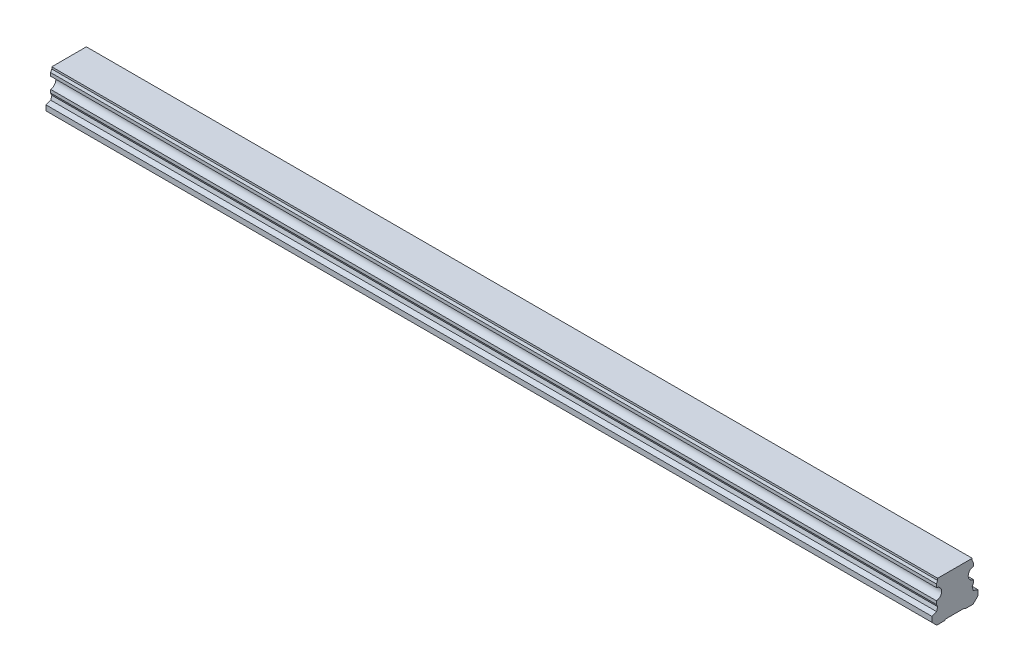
ISO-10303-21;
HEADER;
FILE_DESCRIPTION(('STEP AP214'),'2;1');
FILE_NAME('part.step','',(''),(''),'','','');
FILE_SCHEMA(('AUTOMOTIVE_DESIGN { 1 0 10303 214 1 1 1 1 }'));
ENDSEC;
DATA;
#1=APPLICATION_CONTEXT('core data for automotive mechanical design processes');
#2=APPLICATION_PROTOCOL_DEFINITION('international standard','automotive_design',2000,#1);
#3=PRODUCT_CONTEXT('',#1,'mechanical');
#4=PRODUCT('Part','Part','',(#3));
#5=PRODUCT_RELATED_PRODUCT_CATEGORY('part','',(#4));
#6=PRODUCT_DEFINITION_FORMATION('','',#4);
#7=PRODUCT_DEFINITION_CONTEXT('part definition',#1,'design');
#8=PRODUCT_DEFINITION('design','',#6,#7);
#9=PRODUCT_DEFINITION_SHAPE('','',#8);
#10=(LENGTH_UNIT() NAMED_UNIT(*) SI_UNIT(.MILLI.,.METRE.));
#11=(NAMED_UNIT(*) PLANE_ANGLE_UNIT() SI_UNIT($,.RADIAN.));
#12=(NAMED_UNIT(*) SI_UNIT($,.STERADIAN.) SOLID_ANGLE_UNIT());
#13=UNCERTAINTY_MEASURE_WITH_UNIT(LENGTH_MEASURE(1.E-05),#10,'distance_accuracy_value','');
#14=(GEOMETRIC_REPRESENTATION_CONTEXT(3) GLOBAL_UNCERTAINTY_ASSIGNED_CONTEXT((#13)) GLOBAL_UNIT_ASSIGNED_CONTEXT((#10,
#11,#12)) REPRESENTATION_CONTEXT('',''));
#15=CARTESIAN_POINT('',(0.,0.,0.));
#16=DIRECTION('',(0.,0.,1.));
#17=DIRECTION('',(1.,0.,0.));
#18=AXIS2_PLACEMENT_3D('',#15,#16,#17);
#19=CARTESIAN_POINT('',(450.,0.499999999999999,0.));
#20=DIRECTION('',(0.,-1.,0.));
#21=DIRECTION('',(0.,0.,-1.));
#22=AXIS2_PLACEMENT_3D('',#19,#20,#21);
#23=CONICAL_SURFACE('',#22,3.5,0.785398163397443);
#24=CARTESIAN_POINT('',(450.,1.00000000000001,0.));
#25=DIRECTION('',(0.,1.,0.));
#26=DIRECTION('',(0.,0.,1.));
#27=AXIS2_PLACEMENT_3D('',#24,#25,#26);
#28=CIRCLE('',#27,3.);
#29=CARTESIAN_POINT('',(450.,1.00000000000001,3.));
#30=VERTEX_POINT('',#29);
#31=EDGE_CURVE('E11',#30,#30,#28,.F.);
#32=ORIENTED_EDGE('',*,*,#31,.F.);
#33=EDGE_LOOP('',(#32));
#34=FACE_BOUND('',#33,.T.);
#35=CARTESIAN_POINT('',(450.,0.499999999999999,0.));
#36=DIRECTION('',(0.,1.,0.));
#37=DIRECTION('',(0.,0.,1.));
#38=AXIS2_PLACEMENT_3D('',#35,#36,#37);
#39=CIRCLE('',#38,3.5);
#40=CARTESIAN_POINT('',(450.,0.5,3.5));
#41=VERTEX_POINT('',#40);
#42=EDGE_CURVE('E494',#41,#41,#39,.T.);
#43=ORIENTED_EDGE('',*,*,#42,.F.);
#44=EDGE_LOOP('',(#43));
#45=FACE_BOUND('',#44,.T.);
#46=ADVANCED_FACE('F39',(#34,#45),#23,.F.);
#47=CARTESIAN_POINT('',(450.,12.,0.));
#48=DIRECTION('',(0.,-1.,0.));
#49=DIRECTION('',(0.,0.,-1.));
#50=AXIS2_PLACEMENT_3D('',#47,#48,#49);
#51=CYLINDRICAL_SURFACE('',#50,3.);
#52=ORIENTED_EDGE('',*,*,#31,.T.);
#53=EDGE_LOOP('',(#52));
#54=FACE_BOUND('',#53,.T.);
#55=CARTESIAN_POINT('',(450.,12.,0.));
#56=DIRECTION('',(0.,-1.,0.));
#57=DIRECTION('',(0.,0.,-1.));
#58=AXIS2_PLACEMENT_3D('',#55,#56,#57);
#59=CIRCLE('',#58,3.);
#60=CARTESIAN_POINT('',(450.,12.,-3.));
#61=VERTEX_POINT('',#60);
#62=EDGE_CURVE('E49',#61,#61,#59,.T.);
#63=ORIENTED_EDGE('',*,*,#62,.F.);
#64=EDGE_LOOP('',(#63));
#65=FACE_BOUND('',#64,.T.);
#66=ADVANCED_FACE('F669',(#54,#65),#51,.F.);
#67=CARTESIAN_POINT('',(450.,12.,0.));
#68=DIRECTION('',(0.,-1.,0.));
#69=DIRECTION('',(0.,0.,-1.));
#70=AXIS2_PLACEMENT_3D('',#67,#68,#69);
#71=PLANE('',#70);
#72=CARTESIAN_POINT('',(450.,12.,0.));
#73=DIRECTION('',(0.,-1.,0.));
#74=DIRECTION('',(0.,0.,-1.));
#75=AXIS2_PLACEMENT_3D('',#72,#73,#74);
#76=CIRCLE('',#75,2.5);
#77=CARTESIAN_POINT('',(450.,12.,-2.5));
#78=VERTEX_POINT('',#77);
#79=EDGE_CURVE('E42',#78,#78,#76,.T.);
#80=ORIENTED_EDGE('',*,*,#79,.F.);
#81=EDGE_LOOP('',(#80));
#82=FACE_BOUND('',#81,.T.);
#83=ORIENTED_EDGE('',*,*,#62,.T.);
#84=EDGE_LOOP('',(#83));
#85=FACE_BOUND('',#84,.T.);
#86=ADVANCED_FACE('F674',(#82,#85),#71,.T.);
#87=CARTESIAN_POINT('',(390.,0.499999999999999,0.));
#88=DIRECTION('',(0.,-1.,0.));
#89=DIRECTION('',(0.,0.,-1.));
#90=AXIS2_PLACEMENT_3D('',#87,#88,#89);
#91=CONICAL_SURFACE('',#90,3.5,0.785398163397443);
#92=CARTESIAN_POINT('',(390.,1.00000000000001,0.));
#93=DIRECTION('',(0.,1.,0.));
#94=DIRECTION('',(0.,0.,1.));
#95=AXIS2_PLACEMENT_3D('',#92,#93,#94);
#96=CIRCLE('',#95,3.);
#97=CARTESIAN_POINT('',(390.,1.00000000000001,3.));
#98=VERTEX_POINT('',#97);
#99=EDGE_CURVE('E490',#98,#98,#96,.F.);
#100=ORIENTED_EDGE('',*,*,#99,.F.);
#101=EDGE_LOOP('',(#100));
#102=FACE_BOUND('',#101,.T.);
#103=CARTESIAN_POINT('',(390.,0.499999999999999,0.));
#104=DIRECTION('',(0.,1.,0.));
#105=DIRECTION('',(0.,0.,1.));
#106=AXIS2_PLACEMENT_3D('',#103,#104,#105);
#107=CIRCLE('',#106,3.5);
#108=CARTESIAN_POINT('',(390.,0.5,3.5));
#109=VERTEX_POINT('',#108);
#110=EDGE_CURVE('E482',#109,#109,#107,.T.);
#111=ORIENTED_EDGE('',*,*,#110,.F.);
#112=EDGE_LOOP('',(#111));
#113=FACE_BOUND('',#112,.T.);
#114=ADVANCED_FACE('F809',(#102,#113),#91,.F.);
#115=CARTESIAN_POINT('',(390.,12.,0.));
#116=DIRECTION('',(0.,-1.,0.));
#117=DIRECTION('',(0.,0.,-1.));
#118=AXIS2_PLACEMENT_3D('',#115,#116,#117);
#119=CYLINDRICAL_SURFACE('',#118,3.);
#120=ORIENTED_EDGE('',*,*,#99,.T.);
#121=EDGE_LOOP('',(#120));
#122=FACE_BOUND('',#121,.T.);
#123=CARTESIAN_POINT('',(390.,12.,0.));
#124=DIRECTION('',(0.,-1.,0.));
#125=DIRECTION('',(0.,0.,-1.));
#126=AXIS2_PLACEMENT_3D('',#123,#124,#125);
#127=CIRCLE('',#126,3.);
#128=CARTESIAN_POINT('',(390.,12.,-3.));
#129=VERTEX_POINT('',#128);
#130=EDGE_CURVE('E486',#129,#129,#127,.T.);
#131=ORIENTED_EDGE('',*,*,#130,.F.);
#132=EDGE_LOOP('',(#131));
#133=FACE_BOUND('',#132,.T.);
#134=ADVANCED_FACE('F805',(#122,#133),#119,.F.);
#135=CARTESIAN_POINT('',(390.,12.,0.));
#136=DIRECTION('',(0.,-1.,0.));
#137=DIRECTION('',(0.,0.,-1.));
#138=AXIS2_PLACEMENT_3D('',#135,#136,#137);
#139=PLANE('',#138);
#140=CARTESIAN_POINT('',(390.,12.,0.));
#141=DIRECTION('',(0.,-1.,0.));
#142=DIRECTION('',(0.,0.,-1.));
#143=AXIS2_PLACEMENT_3D('',#140,#141,#142);
#144=CIRCLE('',#143,2.5);
#145=CARTESIAN_POINT('',(390.,12.,-2.5));
#146=VERTEX_POINT('',#145);
#147=EDGE_CURVE('E520',#146,#146,#144,.T.);
#148=ORIENTED_EDGE('',*,*,#147,.F.);
#149=EDGE_LOOP('',(#148));
#150=FACE_BOUND('',#149,.T.);
#151=ORIENTED_EDGE('',*,*,#130,.T.);
#152=EDGE_LOOP('',(#151));
#153=FACE_BOUND('',#152,.T.);
#154=ADVANCED_FACE('F801',(#150,#153),#139,.T.);
#155=CARTESIAN_POINT('',(330.,0.499999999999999,0.));
#156=DIRECTION('',(0.,-1.,0.));
#157=DIRECTION('',(0.,0.,-1.));
#158=AXIS2_PLACEMENT_3D('',#155,#156,#157);
#159=CONICAL_SURFACE('',#158,3.5,0.785398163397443);
#160=CARTESIAN_POINT('',(330.,1.00000000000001,0.));
#161=DIRECTION('',(0.,1.,0.));
#162=DIRECTION('',(0.,0.,1.));
#163=AXIS2_PLACEMENT_3D('',#160,#161,#162);
#164=CIRCLE('',#163,3.);
#165=CARTESIAN_POINT('',(330.,1.00000000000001,3.));
#166=VERTEX_POINT('',#165);
#167=EDGE_CURVE('E478',#166,#166,#164,.F.);
#168=ORIENTED_EDGE('',*,*,#167,.F.);
#169=EDGE_LOOP('',(#168));
#170=FACE_BOUND('',#169,.T.);
#171=CARTESIAN_POINT('',(330.,0.499999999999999,0.));
#172=DIRECTION('',(0.,1.,0.));
#173=DIRECTION('',(0.,0.,1.));
#174=AXIS2_PLACEMENT_3D('',#171,#172,#173);
#175=CIRCLE('',#174,3.5);
#176=CARTESIAN_POINT('',(330.,0.5,3.5));
#177=VERTEX_POINT('',#176);
#178=EDGE_CURVE('E470',#177,#177,#175,.T.);
#179=ORIENTED_EDGE('',*,*,#178,.F.);
#180=EDGE_LOOP('',(#179));
#181=FACE_BOUND('',#180,.T.);
#182=ADVANCED_FACE('F797',(#170,#181),#159,.F.);
#183=CARTESIAN_POINT('',(330.,12.,0.));
#184=DIRECTION('',(0.,-1.,0.));
#185=DIRECTION('',(0.,0.,-1.));
#186=AXIS2_PLACEMENT_3D('',#183,#184,#185);
#187=CYLINDRICAL_SURFACE('',#186,3.);
#188=ORIENTED_EDGE('',*,*,#167,.T.);
#189=EDGE_LOOP('',(#188));
#190=FACE_BOUND('',#189,.T.);
#191=CARTESIAN_POINT('',(330.,12.,0.));
#192=DIRECTION('',(0.,-1.,0.));
#193=DIRECTION('',(0.,0.,-1.));
#194=AXIS2_PLACEMENT_3D('',#191,#192,#193);
#195=CIRCLE('',#194,3.);
#196=CARTESIAN_POINT('',(330.,12.,-3.));
#197=VERTEX_POINT('',#196);
#198=EDGE_CURVE('E474',#197,#197,#195,.T.);
#199=ORIENTED_EDGE('',*,*,#198,.F.);
#200=EDGE_LOOP('',(#199));
#201=FACE_BOUND('',#200,.T.);
#202=ADVANCED_FACE('F793',(#190,#201),#187,.F.);
#203=CARTESIAN_POINT('',(330.,12.,0.));
#204=DIRECTION('',(0.,-1.,0.));
#205=DIRECTION('',(0.,0.,-1.));
#206=AXIS2_PLACEMENT_3D('',#203,#204,#205);
#207=PLANE('',#206);
#208=CARTESIAN_POINT('',(330.,12.,0.));
#209=DIRECTION('',(0.,-1.,0.));
#210=DIRECTION('',(0.,0.,-1.));
#211=AXIS2_PLACEMENT_3D('',#208,#209,#210);
#212=CIRCLE('',#211,2.5);
#213=CARTESIAN_POINT('',(330.,12.,-2.5));
#214=VERTEX_POINT('',#213);
#215=EDGE_CURVE('E517',#214,#214,#212,.T.);
#216=ORIENTED_EDGE('',*,*,#215,.F.);
#217=EDGE_LOOP('',(#216));
#218=FACE_BOUND('',#217,.T.);
#219=ORIENTED_EDGE('',*,*,#198,.T.);
#220=EDGE_LOOP('',(#219));
#221=FACE_BOUND('',#220,.T.);
#222=ADVANCED_FACE('F789',(#218,#221),#207,.T.);
#223=CARTESIAN_POINT('',(270.,0.499999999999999,0.));
#224=DIRECTION('',(0.,-1.,0.));
#225=DIRECTION('',(0.,0.,-1.));
#226=AXIS2_PLACEMENT_3D('',#223,#224,#225);
#227=CONICAL_SURFACE('',#226,3.5,0.785398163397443);
#228=CARTESIAN_POINT('',(270.,1.00000000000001,0.));
#229=DIRECTION('',(0.,1.,0.));
#230=DIRECTION('',(0.,0.,1.));
#231=AXIS2_PLACEMENT_3D('',#228,#229,#230);
#232=CIRCLE('',#231,3.);
#233=CARTESIAN_POINT('',(270.,1.00000000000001,3.));
#234=VERTEX_POINT('',#233);
#235=EDGE_CURVE('E466',#234,#234,#232,.F.);
#236=ORIENTED_EDGE('',*,*,#235,.F.);
#237=EDGE_LOOP('',(#236));
#238=FACE_BOUND('',#237,.T.);
#239=CARTESIAN_POINT('',(270.,0.499999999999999,0.));
#240=DIRECTION('',(0.,1.,0.));
#241=DIRECTION('',(0.,0.,1.));
#242=AXIS2_PLACEMENT_3D('',#239,#240,#241);
#243=CIRCLE('',#242,3.5);
#244=CARTESIAN_POINT('',(270.,0.5,3.5));
#245=VERTEX_POINT('',#244);
#246=EDGE_CURVE('E458',#245,#245,#243,.T.);
#247=ORIENTED_EDGE('',*,*,#246,.F.);
#248=EDGE_LOOP('',(#247));
#249=FACE_BOUND('',#248,.T.);
#250=ADVANCED_FACE('F785',(#238,#249),#227,.F.);
#251=CARTESIAN_POINT('',(270.,12.,0.));
#252=DIRECTION('',(0.,-1.,0.));
#253=DIRECTION('',(0.,0.,-1.));
#254=AXIS2_PLACEMENT_3D('',#251,#252,#253);
#255=CYLINDRICAL_SURFACE('',#254,3.);
#256=ORIENTED_EDGE('',*,*,#235,.T.);
#257=EDGE_LOOP('',(#256));
#258=FACE_BOUND('',#257,.T.);
#259=CARTESIAN_POINT('',(270.,12.,0.));
#260=DIRECTION('',(0.,-1.,0.));
#261=DIRECTION('',(0.,0.,-1.));
#262=AXIS2_PLACEMENT_3D('',#259,#260,#261);
#263=CIRCLE('',#262,3.);
#264=CARTESIAN_POINT('',(270.,12.,-3.));
#265=VERTEX_POINT('',#264);
#266=EDGE_CURVE('E462',#265,#265,#263,.T.);
#267=ORIENTED_EDGE('',*,*,#266,.F.);
#268=EDGE_LOOP('',(#267));
#269=FACE_BOUND('',#268,.T.);
#270=ADVANCED_FACE('F781',(#258,#269),#255,.F.);
#271=CARTESIAN_POINT('',(270.,12.,0.));
#272=DIRECTION('',(0.,-1.,0.));
#273=DIRECTION('',(0.,0.,-1.));
#274=AXIS2_PLACEMENT_3D('',#271,#272,#273);
#275=PLANE('',#274);
#276=CARTESIAN_POINT('',(270.,12.,0.));
#277=DIRECTION('',(0.,-1.,0.));
#278=DIRECTION('',(0.,0.,-1.));
#279=AXIS2_PLACEMENT_3D('',#276,#277,#278);
#280=CIRCLE('',#279,2.5);
#281=CARTESIAN_POINT('',(270.,12.,-2.5));
#282=VERTEX_POINT('',#281);
#283=EDGE_CURVE('E513',#282,#282,#280,.T.);
#284=ORIENTED_EDGE('',*,*,#283,.F.);
#285=EDGE_LOOP('',(#284));
#286=FACE_BOUND('',#285,.T.);
#287=ORIENTED_EDGE('',*,*,#266,.T.);
#288=EDGE_LOOP('',(#287));
#289=FACE_BOUND('',#288,.T.);
#290=ADVANCED_FACE('F777',(#286,#289),#275,.T.);
#291=CARTESIAN_POINT('',(210.,0.499999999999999,0.));
#292=DIRECTION('',(0.,-1.,0.));
#293=DIRECTION('',(0.,0.,-1.));
#294=AXIS2_PLACEMENT_3D('',#291,#292,#293);
#295=CONICAL_SURFACE('',#294,3.5,0.785398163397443);
#296=CARTESIAN_POINT('',(210.,1.00000000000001,0.));
#297=DIRECTION('',(0.,1.,0.));
#298=DIRECTION('',(0.,0.,1.));
#299=AXIS2_PLACEMENT_3D('',#296,#297,#298);
#300=CIRCLE('',#299,3.);
#301=CARTESIAN_POINT('',(210.,1.00000000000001,3.));
#302=VERTEX_POINT('',#301);
#303=EDGE_CURVE('E454',#302,#302,#300,.F.);
#304=ORIENTED_EDGE('',*,*,#303,.F.);
#305=EDGE_LOOP('',(#304));
#306=FACE_BOUND('',#305,.T.);
#307=CARTESIAN_POINT('',(210.,0.499999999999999,0.));
#308=DIRECTION('',(0.,1.,0.));
#309=DIRECTION('',(0.,0.,1.));
#310=AXIS2_PLACEMENT_3D('',#307,#308,#309);
#311=CIRCLE('',#310,3.5);
#312=CARTESIAN_POINT('',(210.,0.5,3.5));
#313=VERTEX_POINT('',#312);
#314=EDGE_CURVE('E446',#313,#313,#311,.T.);
#315=ORIENTED_EDGE('',*,*,#314,.F.);
#316=EDGE_LOOP('',(#315));
#317=FACE_BOUND('',#316,.T.);
#318=ADVANCED_FACE('F773',(#306,#317),#295,.F.);
#319=CARTESIAN_POINT('',(210.,12.,0.));
#320=DIRECTION('',(0.,-1.,0.));
#321=DIRECTION('',(0.,0.,-1.));
#322=AXIS2_PLACEMENT_3D('',#319,#320,#321);
#323=CYLINDRICAL_SURFACE('',#322,3.);
#324=ORIENTED_EDGE('',*,*,#303,.T.);
#325=EDGE_LOOP('',(#324));
#326=FACE_BOUND('',#325,.T.);
#327=CARTESIAN_POINT('',(210.,12.,0.));
#328=DIRECTION('',(0.,-1.,0.));
#329=DIRECTION('',(0.,0.,-1.));
#330=AXIS2_PLACEMENT_3D('',#327,#328,#329);
#331=CIRCLE('',#330,3.);
#332=CARTESIAN_POINT('',(210.,12.,-3.));
#333=VERTEX_POINT('',#332);
#334=EDGE_CURVE('E450',#333,#333,#331,.T.);
#335=ORIENTED_EDGE('',*,*,#334,.F.);
#336=EDGE_LOOP('',(#335));
#337=FACE_BOUND('',#336,.T.);
#338=ADVANCED_FACE('F769',(#326,#337),#323,.F.);
#339=CARTESIAN_POINT('',(210.,12.,0.));
#340=DIRECTION('',(0.,-1.,0.));
#341=DIRECTION('',(0.,0.,-1.));
#342=AXIS2_PLACEMENT_3D('',#339,#340,#341);
#343=PLANE('',#342);
#344=CARTESIAN_POINT('',(210.,12.,0.));
#345=DIRECTION('',(0.,-1.,0.));
#346=DIRECTION('',(0.,0.,-1.));
#347=AXIS2_PLACEMENT_3D('',#344,#345,#346);
#348=CIRCLE('',#347,2.5);
#349=CARTESIAN_POINT('',(210.,12.,-2.5));
#350=VERTEX_POINT('',#349);
#351=EDGE_CURVE('E509',#350,#350,#348,.T.);
#352=ORIENTED_EDGE('',*,*,#351,.F.);
#353=EDGE_LOOP('',(#352));
#354=FACE_BOUND('',#353,.T.);
#355=ORIENTED_EDGE('',*,*,#334,.T.);
#356=EDGE_LOOP('',(#355));
#357=FACE_BOUND('',#356,.T.);
#358=ADVANCED_FACE('F765',(#354,#357),#343,.T.);
#359=CARTESIAN_POINT('',(150.,0.499999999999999,0.));
#360=DIRECTION('',(0.,-1.,0.));
#361=DIRECTION('',(0.,0.,-1.));
#362=AXIS2_PLACEMENT_3D('',#359,#360,#361);
#363=CONICAL_SURFACE('',#362,3.5,0.785398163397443);
#364=CARTESIAN_POINT('',(150.,1.00000000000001,0.));
#365=DIRECTION('',(0.,1.,0.));
#366=DIRECTION('',(0.,0.,1.));
#367=AXIS2_PLACEMENT_3D('',#364,#365,#366);
#368=CIRCLE('',#367,3.);
#369=CARTESIAN_POINT('',(150.,1.00000000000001,3.));
#370=VERTEX_POINT('',#369);
#371=EDGE_CURVE('E442',#370,#370,#368,.F.);
#372=ORIENTED_EDGE('',*,*,#371,.F.);
#373=EDGE_LOOP('',(#372));
#374=FACE_BOUND('',#373,.T.);
#375=CARTESIAN_POINT('',(150.,0.499999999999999,0.));
#376=DIRECTION('',(0.,1.,0.));
#377=DIRECTION('',(0.,0.,1.));
#378=AXIS2_PLACEMENT_3D('',#375,#376,#377);
#379=CIRCLE('',#378,3.5);
#380=CARTESIAN_POINT('',(150.,0.5,3.5));
#381=VERTEX_POINT('',#380);
#382=EDGE_CURVE('E434',#381,#381,#379,.T.);
#383=ORIENTED_EDGE('',*,*,#382,.F.);
#384=EDGE_LOOP('',(#383));
#385=FACE_BOUND('',#384,.T.);
#386=ADVANCED_FACE('F761',(#374,#385),#363,.F.);
#387=CARTESIAN_POINT('',(150.,12.,0.));
#388=DIRECTION('',(0.,-1.,0.));
#389=DIRECTION('',(0.,0.,-1.));
#390=AXIS2_PLACEMENT_3D('',#387,#388,#389);
#391=CYLINDRICAL_SURFACE('',#390,3.);
#392=ORIENTED_EDGE('',*,*,#371,.T.);
#393=EDGE_LOOP('',(#392));
#394=FACE_BOUND('',#393,.T.);
#395=CARTESIAN_POINT('',(150.,12.,0.));
#396=DIRECTION('',(0.,-1.,0.));
#397=DIRECTION('',(0.,0.,-1.));
#398=AXIS2_PLACEMENT_3D('',#395,#396,#397);
#399=CIRCLE('',#398,3.);
#400=CARTESIAN_POINT('',(150.,12.,-3.));
#401=VERTEX_POINT('',#400);
#402=EDGE_CURVE('E438',#401,#401,#399,.T.);
#403=ORIENTED_EDGE('',*,*,#402,.F.);
#404=EDGE_LOOP('',(#403));
#405=FACE_BOUND('',#404,.T.);
#406=ADVANCED_FACE('F757',(#394,#405),#391,.F.);
#407=CARTESIAN_POINT('',(150.,12.,0.));
#408=DIRECTION('',(0.,-1.,0.));
#409=DIRECTION('',(0.,0.,-1.));
#410=AXIS2_PLACEMENT_3D('',#407,#408,#409);
#411=PLANE('',#410);
#412=CARTESIAN_POINT('',(150.,12.,0.));
#413=DIRECTION('',(0.,-1.,0.));
#414=DIRECTION('',(0.,0.,-1.));
#415=AXIS2_PLACEMENT_3D('',#412,#413,#414);
#416=CIRCLE('',#415,2.5);
#417=CARTESIAN_POINT('',(150.,12.,-2.5));
#418=VERTEX_POINT('',#417);
#419=EDGE_CURVE('E504',#418,#418,#416,.T.);
#420=ORIENTED_EDGE('',*,*,#419,.F.);
#421=EDGE_LOOP('',(#420));
#422=FACE_BOUND('',#421,.T.);
#423=ORIENTED_EDGE('',*,*,#402,.T.);
#424=EDGE_LOOP('',(#423));
#425=FACE_BOUND('',#424,.T.);
#426=ADVANCED_FACE('F747',(#422,#425),#411,.T.);
#427=CARTESIAN_POINT('',(480.,21.8,-9.375));
#428=DIRECTION('',(0.,0.,1.));
#429=DIRECTION('',(0.,-1.,0.));
#430=AXIS2_PLACEMENT_3D('',#427,#428,#429);
#431=PLANE('',#430);
#432=DIRECTION('',(0.,1.,0.));
#433=VECTOR('',#432,1.);
#434=CARTESIAN_POINT('',(0.,21.8,-9.375));
#435=LINE('',#434,#433);
#436=CARTESIAN_POINT('',(0.,20.756,-9.375));
#437=VERTEX_POINT('',#436);
#438=CARTESIAN_POINT('',(0.,21.8,-9.375));
#439=VERTEX_POINT('',#438);
#440=EDGE_CURVE('E256',#437,#439,#435,.T.);
#441=ORIENTED_EDGE('',*,*,#440,.T.);
#442=DIRECTION('',(-1.,0.,0.));
#443=VECTOR('',#442,1.);
#444=CARTESIAN_POINT('',(480.,21.8,-9.375));
#445=LINE('',#444,#443);
#446=CARTESIAN_POINT('',(480.,21.8,-9.375));
#447=VERTEX_POINT('',#446);
#448=EDGE_CURVE('E423',#447,#439,#445,.T.);
#449=ORIENTED_EDGE('',*,*,#448,.F.);
#450=DIRECTION('',(0.,1.,0.));
#451=VECTOR('',#450,1.);
#452=CARTESIAN_POINT('',(480.,21.8,-9.375));
#453=LINE('',#452,#451);
#454=CARTESIAN_POINT('',(480.,20.756,-9.375));
#455=VERTEX_POINT('',#454);
#456=EDGE_CURVE('E333',#455,#447,#453,.T.);
#457=ORIENTED_EDGE('',*,*,#456,.F.);
#458=DIRECTION('',(-1.,0.,0.));
#459=VECTOR('',#458,1.);
#460=CARTESIAN_POINT('',(480.,20.756,-9.375));
#461=LINE('',#460,#459);
#462=EDGE_CURVE('E252',#455,#437,#461,.T.);
#463=ORIENTED_EDGE('',*,*,#462,.T.);
#464=EDGE_LOOP('',(#441,#449,#457,#463));
#465=FACE_BOUND('',#464,.T.);
#466=ADVANCED_FACE('F744',(#465),#431,.F.);
#467=CARTESIAN_POINT('',(480.,21.8,-9.375));
#468=DIRECTION('',(0.,-1.,0.));
#469=DIRECTION('',(0.,0.,-1.));
#470=AXIS2_PLACEMENT_3D('',#467,#468,#469);
#471=PLANE('',#470);
#472=DIRECTION('',(0.,0.,1.));
#473=VECTOR('',#472,1.);
#474=CARTESIAN_POINT('',(0.,21.8,-9.375));
#475=LINE('',#474,#473);
#476=CARTESIAN_POINT('',(0.,21.8,9.375));
#477=VERTEX_POINT('',#476);
#478=EDGE_CURVE('E260',#439,#477,#475,.T.);
#479=ORIENTED_EDGE('',*,*,#478,.T.);
#480=DIRECTION('',(-1.,0.,0.));
#481=VECTOR('',#480,1.);
#482=CARTESIAN_POINT('',(480.,21.8,9.375));
#483=LINE('',#482,#481);
#484=CARTESIAN_POINT('',(480.,21.8,9.375));
#485=VERTEX_POINT('',#484);
#486=EDGE_CURVE('E419',#485,#477,#483,.T.);
#487=ORIENTED_EDGE('',*,*,#486,.F.);
#488=DIRECTION('',(0.,0.,1.));
#489=VECTOR('',#488,1.);
#490=CARTESIAN_POINT('',(480.,21.8,-9.375));
#491=LINE('',#490,#489);
#492=EDGE_CURVE('E157',#447,#485,#491,.T.);
#493=ORIENTED_EDGE('',*,*,#492,.F.);
#494=ORIENTED_EDGE('',*,*,#448,.T.);
#495=EDGE_LOOP('',(#479,#487,#493,#494));
#496=FACE_BOUND('',#495,.T.);
#497=ADVANCED_FACE('F740',(#496),#471,.F.);
#498=CARTESIAN_POINT('',(480.,21.8,9.375));
#499=DIRECTION('',(0.,0.,-1.));
#500=DIRECTION('',(0.,1.,0.));
#501=AXIS2_PLACEMENT_3D('',#498,#499,#500);
#502=PLANE('',#501);
#503=DIRECTION('',(0.,-1.,0.));
#504=VECTOR('',#503,1.);
#505=CARTESIAN_POINT('',(0.,21.8,9.375));
#506=LINE('',#505,#504);
#507=CARTESIAN_POINT('',(0.,20.756,9.37499999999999));
#508=VERTEX_POINT('',#507);
#509=EDGE_CURVE('E264',#477,#508,#506,.T.);
#510=ORIENTED_EDGE('',*,*,#509,.T.);
#511=DIRECTION('',(-1.,0.,0.));
#512=VECTOR('',#511,1.);
#513=CARTESIAN_POINT('',(480.,20.756,9.37499999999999));
#514=LINE('',#513,#512);
#515=CARTESIAN_POINT('',(480.,20.756,9.37499999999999));
#516=VERTEX_POINT('',#515);
#517=EDGE_CURVE('E415',#516,#508,#514,.T.);
#518=ORIENTED_EDGE('',*,*,#517,.F.);
#519=DIRECTION('',(0.,-1.,0.));
#520=VECTOR('',#519,1.);
#521=CARTESIAN_POINT('',(480.,21.8,9.375));
#522=LINE('',#521,#520);
#523=EDGE_CURVE('E563',#485,#516,#522,.T.);
#524=ORIENTED_EDGE('',*,*,#523,.F.);
#525=ORIENTED_EDGE('',*,*,#486,.T.);
#526=EDGE_LOOP('',(#510,#518,#524,#525));
#527=FACE_BOUND('',#526,.T.);
#528=ADVANCED_FACE('F736',(#527),#502,.F.);
#529=CARTESIAN_POINT('',(480.,20.756,9.37499999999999));
#530=DIRECTION('',(0.,-0.422618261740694,-0.906307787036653));
#531=DIRECTION('',(0.,0.906307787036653,-0.422618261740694));
#532=AXIS2_PLACEMENT_3D('',#529,#530,#531);
#533=PLANE('',#532);
#534=DIRECTION('',(0.,-0.906307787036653,0.422618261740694));
#535=VECTOR('',#534,1.);
#536=CARTESIAN_POINT('',(0.,20.756,9.37499999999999));
#537=LINE('',#536,#535);
#538=CARTESIAN_POINT('',(0.,19.4156831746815,10.));
#539=VERTEX_POINT('',#538);
#540=EDGE_CURVE('E267',#508,#539,#537,.T.);
#541=ORIENTED_EDGE('',*,*,#540,.T.);
#542=DIRECTION('',(-1.,0.,0.));
#543=VECTOR('',#542,1.);
#544=CARTESIAN_POINT('',(480.,19.4156831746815,10.));
#545=LINE('',#544,#543);
#546=CARTESIAN_POINT('',(480.,19.4156831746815,10.));
#547=VERTEX_POINT('',#546);
#548=EDGE_CURVE('E411',#547,#539,#545,.T.);
#549=ORIENTED_EDGE('',*,*,#548,.F.);
#550=DIRECTION('',(0.,-0.906307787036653,0.422618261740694));
#551=VECTOR('',#550,1.);
#552=CARTESIAN_POINT('',(480.,20.756,9.37499999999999));
#553=LINE('',#552,#551);
#554=EDGE_CURVE('E566',#516,#547,#553,.T.);
#555=ORIENTED_EDGE('',*,*,#554,.F.);
#556=ORIENTED_EDGE('',*,*,#517,.T.);
#557=EDGE_LOOP('',(#541,#549,#555,#556));
#558=FACE_BOUND('',#557,.T.);
#559=ADVANCED_FACE('F732',(#558),#533,.F.);
#560=CARTESIAN_POINT('',(480.,19.4156831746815,10.));
#561=DIRECTION('',(0.,0.,-1.));
#562=DIRECTION('',(-1.,0.,0.));
#563=AXIS2_PLACEMENT_3D('',#560,#561,#562);
#564=PLANE('',#563);
#565=DIRECTION('',(0.,-1.,0.));
#566=VECTOR('',#565,1.);
#567=CARTESIAN_POINT('',(0.,19.4156831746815,10.));
#568=LINE('',#567,#566);
#569=CARTESIAN_POINT('',(0.,17.6854497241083,10.));
#570=VERTEX_POINT('',#569);
#571=EDGE_CURVE('E270',#539,#570,#568,.T.);
#572=ORIENTED_EDGE('',*,*,#571,.T.);
#573=DIRECTION('',(-1.,0.,0.));
#574=VECTOR('',#573,1.);
#575=CARTESIAN_POINT('',(480.,17.6854497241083,10.));
#576=LINE('',#575,#574);
#577=CARTESIAN_POINT('',(480.,17.6854497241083,10.));
#578=VERTEX_POINT('',#577);
#579=EDGE_CURVE('E407',#578,#570,#576,.T.);
#580=ORIENTED_EDGE('',*,*,#579,.F.);
#581=DIRECTION('',(0.,-1.,0.));
#582=VECTOR('',#581,1.);
#583=CARTESIAN_POINT('',(480.,19.4156831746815,10.));
#584=LINE('',#583,#582);
#585=EDGE_CURVE('E569',#547,#578,#584,.T.);
#586=ORIENTED_EDGE('',*,*,#585,.F.);
#587=ORIENTED_EDGE('',*,*,#548,.T.);
#588=EDGE_LOOP('',(#572,#580,#586,#587));
#589=FACE_BOUND('',#588,.T.);
#590=ADVANCED_FACE('F728',(#589),#564,.F.);
#591=CARTESIAN_POINT('',(480.,14.6,10.3));
#592=DIRECTION('',(-1.,0.,0.));
#593=DIRECTION('',(0.,0.,1.));
#594=AXIS2_PLACEMENT_3D('',#591,#592,#593);
#595=CYLINDRICAL_SURFACE('',#594,3.1);
#596=CARTESIAN_POINT('',(0.,14.6,10.3));
#597=DIRECTION('',(-1.,0.,0.));
#598=DIRECTION('',(0.,0.,-1.));
#599=AXIS2_PLACEMENT_3D('',#596,#597,#598);
#600=CIRCLE('',#599,3.1);
#601=CARTESIAN_POINT('',(0.,11.5145502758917,10.));
#602=VERTEX_POINT('',#601);
#603=EDGE_CURVE('E273',#570,#602,#600,.T.);
#604=ORIENTED_EDGE('',*,*,#603,.T.);
#605=DIRECTION('',(-1.,0.,0.));
#606=VECTOR('',#605,1.);
#607=CARTESIAN_POINT('',(480.,11.5145502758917,10.));
#608=LINE('',#607,#606);
#609=CARTESIAN_POINT('',(480.,11.5145502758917,10.));
#610=VERTEX_POINT('',#609);
#611=EDGE_CURVE('E403',#610,#602,#608,.T.);
#612=ORIENTED_EDGE('',*,*,#611,.F.);
#613=CARTESIAN_POINT('',(480.,14.6,10.3));
#614=DIRECTION('',(-1.,0.,0.));
#615=DIRECTION('',(0.,0.,-1.));
#616=AXIS2_PLACEMENT_3D('',#613,#614,#615);
#617=CIRCLE('',#616,3.1);
#618=EDGE_CURVE('E572',#578,#610,#617,.T.);
#619=ORIENTED_EDGE('',*,*,#618,.F.);
#620=ORIENTED_EDGE('',*,*,#579,.T.);
#621=EDGE_LOOP('',(#604,#612,#619,#620));
#622=FACE_BOUND('',#621,.T.);
#623=ADVANCED_FACE('F724',(#622),#595,.F.);
#624=CARTESIAN_POINT('',(480.,9.78431682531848,10.));
#625=DIRECTION('',(0.,0.,-1.));
#626=DIRECTION('',(0.,1.,0.));
#627=AXIS2_PLACEMENT_3D('',#624,#625,#626);
#628=PLANE('',#627);
#629=DIRECTION('',(0.,-1.,0.));
#630=VECTOR('',#629,1.);
#631=CARTESIAN_POINT('',(0.,9.78431682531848,10.));
#632=LINE('',#631,#630);
#633=CARTESIAN_POINT('',(0.,9.78431682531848,10.));
#634=VERTEX_POINT('',#633);
#635=EDGE_CURVE('E276',#602,#634,#632,.T.);
#636=ORIENTED_EDGE('',*,*,#635,.T.);
#637=DIRECTION('',(-1.,0.,0.));
#638=VECTOR('',#637,1.);
#639=CARTESIAN_POINT('',(480.,9.78431682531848,10.));
#640=LINE('',#639,#638);
#641=CARTESIAN_POINT('',(480.,9.78431682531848,10.));
#642=VERTEX_POINT('',#641);
#643=EDGE_CURVE('E399',#642,#634,#640,.T.);
#644=ORIENTED_EDGE('',*,*,#643,.F.);
#645=DIRECTION('',(0.,-1.,0.));
#646=VECTOR('',#645,1.);
#647=CARTESIAN_POINT('',(480.,9.78431682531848,10.));
#648=LINE('',#647,#646);
#649=EDGE_CURVE('E575',#610,#642,#648,.T.);
#650=ORIENTED_EDGE('',*,*,#649,.F.);
#651=ORIENTED_EDGE('',*,*,#611,.T.);
#652=EDGE_LOOP('',(#636,#644,#650,#651));
#653=FACE_BOUND('',#652,.T.);
#654=ADVANCED_FACE('F720',(#653),#628,.F.);
#655=CARTESIAN_POINT('',(480.,8.44400000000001,9.375));
#656=DIRECTION('',(0.,0.4226182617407,-0.90630778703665));
#657=DIRECTION('',(0.,0.90630778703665,0.4226182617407));
#658=AXIS2_PLACEMENT_3D('',#655,#656,#657);
#659=PLANE('',#658);
#660=DIRECTION('',(0.,-0.90630778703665,-0.4226182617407));
#661=VECTOR('',#660,1.);
#662=CARTESIAN_POINT('',(0.,8.44400000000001,9.375));
#663=LINE('',#662,#661);
#664=CARTESIAN_POINT('',(0.,8.44400000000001,9.375));
#665=VERTEX_POINT('',#664);
#666=EDGE_CURVE('E279',#634,#665,#663,.T.);
#667=ORIENTED_EDGE('',*,*,#666,.T.);
#668=DIRECTION('',(-1.,0.,0.));
#669=VECTOR('',#668,1.);
#670=CARTESIAN_POINT('',(480.,8.44400000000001,9.375));
#671=LINE('',#670,#669);
#672=CARTESIAN_POINT('',(480.,8.44400000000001,9.375));
#673=VERTEX_POINT('',#672);
#674=EDGE_CURVE('E395',#673,#665,#671,.T.);
#675=ORIENTED_EDGE('',*,*,#674,.F.);
#676=DIRECTION('',(0.,-0.90630778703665,-0.4226182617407));
#677=VECTOR('',#676,1.);
#678=CARTESIAN_POINT('',(480.,8.44400000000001,9.375));
#679=LINE('',#678,#677);
#680=EDGE_CURVE('E578',#642,#673,#679,.T.);
#681=ORIENTED_EDGE('',*,*,#680,.F.);
#682=ORIENTED_EDGE('',*,*,#643,.T.);
#683=EDGE_LOOP('',(#667,#675,#681,#682));
#684=FACE_BOUND('',#683,.T.);
#685=ADVANCED_FACE('F716',(#684),#659,.F.);
#686=CARTESIAN_POINT('',(480.,6.4,9.92268814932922));
#687=DIRECTION('',(0.,-0.258819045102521,-0.965925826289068));
#688=DIRECTION('',(0.,0.965925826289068,-0.258819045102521));
#689=AXIS2_PLACEMENT_3D('',#686,#687,#688);
#690=PLANE('',#689);
#691=DIRECTION('',(0.,-0.965925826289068,0.258819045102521));
#692=VECTOR('',#691,1.);
#693=CARTESIAN_POINT('',(0.,6.4,9.92268814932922));
#694=LINE('',#693,#692);
#695=CARTESIAN_POINT('',(0.,6.4,9.92268814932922));
#696=VERTEX_POINT('',#695);
#697=EDGE_CURVE('E282',#665,#696,#694,.T.);
#698=ORIENTED_EDGE('',*,*,#697,.T.);
#699=DIRECTION('',(-1.,0.,0.));
#700=VECTOR('',#699,1.);
#701=CARTESIAN_POINT('',(480.,6.4,9.92268814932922));
#702=LINE('',#701,#700);
#703=CARTESIAN_POINT('',(480.,6.4,9.92268814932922));
#704=VERTEX_POINT('',#703);
#705=EDGE_CURVE('E391',#704,#696,#702,.T.);
#706=ORIENTED_EDGE('',*,*,#705,.F.);
#707=DIRECTION('',(0.,-0.965925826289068,0.258819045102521));
#708=VECTOR('',#707,1.);
#709=CARTESIAN_POINT('',(480.,6.4,9.92268814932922));
#710=LINE('',#709,#708);
#711=EDGE_CURVE('E581',#673,#704,#710,.T.);
#712=ORIENTED_EDGE('',*,*,#711,.F.);
#713=ORIENTED_EDGE('',*,*,#674,.T.);
#714=EDGE_LOOP('',(#698,#706,#712,#713));
#715=FACE_BOUND('',#714,.T.);
#716=ADVANCED_FACE('F712',(#715),#690,.F.);
#717=CARTESIAN_POINT('',(480.,5.48933857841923,12.5));
#718=DIRECTION('',(0.,-0.942872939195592,-0.333152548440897));
#719=DIRECTION('',(0.,0.333152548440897,-0.942872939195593));
#720=AXIS2_PLACEMENT_3D('',#717,#718,#719);
#721=PLANE('',#720);
#722=DIRECTION('',(0.,-0.333152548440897,0.942872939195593));
#723=VECTOR('',#722,1.);
#724=CARTESIAN_POINT('',(0.,5.48933857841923,12.5));
#725=LINE('',#724,#723);
#726=CARTESIAN_POINT('',(0.,5.48933857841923,12.5));
#727=VERTEX_POINT('',#726);
#728=EDGE_CURVE('E285',#696,#727,#725,.T.);
#729=ORIENTED_EDGE('',*,*,#728,.T.);
#730=DIRECTION('',(-1.,0.,0.));
#731=VECTOR('',#730,1.);
#732=CARTESIAN_POINT('',(480.,5.48933857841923,12.5));
#733=LINE('',#732,#731);
#734=CARTESIAN_POINT('',(480.,5.48933857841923,12.5));
#735=VERTEX_POINT('',#734);
#736=EDGE_CURVE('E387',#735,#727,#733,.T.);
#737=ORIENTED_EDGE('',*,*,#736,.F.);
#738=DIRECTION('',(0.,-0.333152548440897,0.942872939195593));
#739=VECTOR('',#738,1.);
#740=CARTESIAN_POINT('',(480.,5.48933857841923,12.5));
#741=LINE('',#740,#739);
#742=EDGE_CURVE('E584',#704,#735,#741,.T.);
#743=ORIENTED_EDGE('',*,*,#742,.F.);
#744=ORIENTED_EDGE('',*,*,#705,.T.);
#745=EDGE_LOOP('',(#729,#737,#743,#744));
#746=FACE_BOUND('',#745,.T.);
#747=ADVANCED_FACE('F708',(#746),#721,.F.);
#748=CARTESIAN_POINT('',(480.,2.65,12.5));
#749=DIRECTION('',(0.,0.,-1.));
#750=DIRECTION('',(0.,1.,0.));
#751=AXIS2_PLACEMENT_3D('',#748,#749,#750);
#752=PLANE('',#751);
#753=DIRECTION('',(0.,-1.,0.));
#754=VECTOR('',#753,1.);
#755=CARTESIAN_POINT('',(0.,2.65,12.5));
#756=LINE('',#755,#754);
#757=CARTESIAN_POINT('',(0.,2.65,12.5));
#758=VERTEX_POINT('',#757);
#759=EDGE_CURVE('E288',#727,#758,#756,.T.);
#760=ORIENTED_EDGE('',*,*,#759,.T.);
#761=DIRECTION('',(-1.,0.,0.));
#762=VECTOR('',#761,1.);
#763=CARTESIAN_POINT('',(480.,2.65,12.5));
#764=LINE('',#763,#762);
#765=CARTESIAN_POINT('',(480.,2.65,12.5));
#766=VERTEX_POINT('',#765);
#767=EDGE_CURVE('E383',#766,#758,#764,.T.);
#768=ORIENTED_EDGE('',*,*,#767,.F.);
#769=DIRECTION('',(0.,-1.,0.));
#770=VECTOR('',#769,1.);
#771=CARTESIAN_POINT('',(480.,2.65,12.5));
#772=LINE('',#771,#770);
#773=EDGE_CURVE('E587',#735,#766,#772,.T.);
#774=ORIENTED_EDGE('',*,*,#773,.F.);
#775=ORIENTED_EDGE('',*,*,#736,.T.);
#776=EDGE_LOOP('',(#760,#768,#774,#775));
#777=FACE_BOUND('',#776,.T.);
#778=ADVANCED_FACE('F704',(#777),#752,.F.);
#779=CARTESIAN_POINT('',(480.,0.,9.85));
#780=DIRECTION('',(0.,0.707106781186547,-0.707106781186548));
#781=DIRECTION('',(0.,0.707106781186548,0.707106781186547));
#782=AXIS2_PLACEMENT_3D('',#779,#780,#781);
#783=PLANE('',#782);
#784=DIRECTION('',(0.,-0.707106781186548,-0.707106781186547));
#785=VECTOR('',#784,1.);
#786=CARTESIAN_POINT('',(0.,0.,9.85));
#787=LINE('',#786,#785);
#788=CARTESIAN_POINT('',(0.,0.,9.85));
#789=VERTEX_POINT('',#788);
#790=EDGE_CURVE('E291',#758,#789,#787,.T.);
#791=ORIENTED_EDGE('',*,*,#790,.T.);
#792=DIRECTION('',(-1.,0.,0.));
#793=VECTOR('',#792,1.);
#794=CARTESIAN_POINT('',(480.,0.,9.85));
#795=LINE('',#794,#793);
#796=CARTESIAN_POINT('',(480.,0.,9.85));
#797=VERTEX_POINT('',#796);
#798=EDGE_CURVE('E379',#797,#789,#795,.T.);
#799=ORIENTED_EDGE('',*,*,#798,.F.);
#800=DIRECTION('',(0.,-0.707106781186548,-0.707106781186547));
#801=VECTOR('',#800,1.);
#802=CARTESIAN_POINT('',(480.,0.,9.85));
#803=LINE('',#802,#801);
#804=EDGE_CURVE('E590',#766,#797,#803,.T.);
#805=ORIENTED_EDGE('',*,*,#804,.F.);
#806=ORIENTED_EDGE('',*,*,#767,.T.);
#807=EDGE_LOOP('',(#791,#799,#805,#806));
#808=FACE_BOUND('',#807,.T.);
#809=ADVANCED_FACE('F700',(#808),#783,.F.);
#810=CARTESIAN_POINT('',(480.,0.,5.5));
#811=DIRECTION('',(0.,1.,0.));
#812=DIRECTION('',(0.,0.,1.));
#813=AXIS2_PLACEMENT_3D('',#810,#811,#812);
#814=PLANE('',#813);
#815=DIRECTION('',(0.,0.,-1.));
#816=VECTOR('',#815,1.);
#817=CARTESIAN_POINT('',(0.,0.,5.5));
#818=LINE('',#817,#816);
#819=CARTESIAN_POINT('',(0.,0.,5.5));
#820=VERTEX_POINT('',#819);
#821=EDGE_CURVE('E294',#789,#820,#818,.T.);
#822=ORIENTED_EDGE('',*,*,#821,.T.);
#823=DIRECTION('',(-1.,0.,0.));
#824=VECTOR('',#823,1.);
#825=CARTESIAN_POINT('',(480.,0.,5.5));
#826=LINE('',#825,#824);
#827=CARTESIAN_POINT('',(480.,0.,5.5));
#828=VERTEX_POINT('',#827);
#829=EDGE_CURVE('E375',#828,#820,#826,.T.);
#830=ORIENTED_EDGE('',*,*,#829,.F.);
#831=DIRECTION('',(0.,0.,-1.));
#832=VECTOR('',#831,1.);
#833=CARTESIAN_POINT('',(480.,0.,5.5));
#834=LINE('',#833,#832);
#835=EDGE_CURVE('E593',#797,#828,#834,.T.);
#836=ORIENTED_EDGE('',*,*,#835,.F.);
#837=ORIENTED_EDGE('',*,*,#798,.T.);
#838=EDGE_LOOP('',(#822,#830,#836,#837));
#839=FACE_BOUND('',#838,.T.);
#840=ADVANCED_FACE('F692',(#839),#814,.F.);
#841=CARTESIAN_POINT('',(480.,0.5,5.));
#842=DIRECTION('',(0.,0.707106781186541,0.707106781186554));
#843=DIRECTION('',(0.,-0.707106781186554,0.707106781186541));
#844=AXIS2_PLACEMENT_3D('',#841,#842,#843);
#845=PLANE('',#844);
#846=DIRECTION('',(0.,0.707106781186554,-0.707106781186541));
#847=VECTOR('',#846,1.);
#848=CARTESIAN_POINT('',(0.,0.5,5.));
#849=LINE('',#848,#847);
#850=CARTESIAN_POINT('',(0.,0.5,5.));
#851=VERTEX_POINT('',#850);
#852=EDGE_CURVE('E297',#820,#851,#849,.T.);
#853=ORIENTED_EDGE('',*,*,#852,.T.);
#854=DIRECTION('',(-1.,0.,0.));
#855=VECTOR('',#854,1.);
#856=CARTESIAN_POINT('',(480.,0.5,5.));
#857=LINE('',#856,#855);
#858=CARTESIAN_POINT('',(480.,0.5,5.));
#859=VERTEX_POINT('',#858);
#860=EDGE_CURVE('E371',#859,#851,#857,.T.);
#861=ORIENTED_EDGE('',*,*,#860,.F.);
#862=DIRECTION('',(0.,0.707106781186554,-0.707106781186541));
#863=VECTOR('',#862,1.);
#864=CARTESIAN_POINT('',(480.,0.5,5.));
#865=LINE('',#864,#863);
#866=EDGE_CURVE('E596',#828,#859,#865,.T.);
#867=ORIENTED_EDGE('',*,*,#866,.F.);
#868=ORIENTED_EDGE('',*,*,#829,.T.);
#869=EDGE_LOOP('',(#853,#861,#867,#868));
#870=FACE_BOUND('',#869,.T.);
#871=ADVANCED_FACE('F683',(#870),#845,.F.);
#872=CARTESIAN_POINT('',(480.,0.499999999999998,-5.));
#873=DIRECTION('',(0.,1.,0.));
#874=DIRECTION('',(0.,0.,1.));
#875=AXIS2_PLACEMENT_3D('',#872,#873,#874);
#876=PLANE('',#875);
#877=CARTESIAN_POINT('',(90.,0.499999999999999,0.));
#878=DIRECTION('',(0.,1.,0.));
#879=DIRECTION('',(0.,0.,1.));
#880=AXIS2_PLACEMENT_3D('',#877,#878,#879);
#881=CIRCLE('',#880,3.5);
#882=CARTESIAN_POINT('',(90.,0.5,3.5));
#883=VERTEX_POINT('',#882);
#884=EDGE_CURVE('E528',#883,#883,#881,.T.);
#885=ORIENTED_EDGE('',*,*,#884,.T.);
#886=EDGE_LOOP('',(#885));
#887=FACE_BOUND('',#886,.T.);
#888=CARTESIAN_POINT('',(30.,0.499999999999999,0.));
#889=DIRECTION('',(0.,1.,0.));
#890=DIRECTION('',(0.,0.,1.));
#891=AXIS2_PLACEMENT_3D('',#888,#889,#890);
#892=CIRCLE('',#891,3.5);
#893=CARTESIAN_POINT('',(30.,0.5,3.5));
#894=VERTEX_POINT('',#893);
#895=EDGE_CURVE('E426',#894,#894,#892,.T.);
#896=ORIENTED_EDGE('',*,*,#895,.T.);
#897=EDGE_LOOP('',(#896));
#898=FACE_BOUND('',#897,.T.);
#899=DIRECTION('',(0.,0.,-1.));
#900=VECTOR('',#899,1.);
#901=CARTESIAN_POINT('',(0.,0.499999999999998,-5.));
#902=LINE('',#901,#900);
#903=CARTESIAN_POINT('',(0.,0.499999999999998,-5.));
#904=VERTEX_POINT('',#903);
#905=EDGE_CURVE('E300',#851,#904,#902,.T.);
#906=ORIENTED_EDGE('',*,*,#905,.T.);
#907=DIRECTION('',(-1.,0.,0.));
#908=VECTOR('',#907,1.);
#909=CARTESIAN_POINT('',(480.,0.499999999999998,-5.));
#910=LINE('',#909,#908);
#911=CARTESIAN_POINT('',(480.,0.499999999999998,-5.));
#912=VERTEX_POINT('',#911);
#913=EDGE_CURVE('E367',#912,#904,#910,.T.);
#914=ORIENTED_EDGE('',*,*,#913,.F.);
#915=DIRECTION('',(0.,0.,-1.));
#916=VECTOR('',#915,1.);
#917=CARTESIAN_POINT('',(480.,0.499999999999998,-5.));
#918=LINE('',#917,#916);
#919=EDGE_CURVE('E599',#859,#912,#918,.T.);
#920=ORIENTED_EDGE('',*,*,#919,.F.);
#921=ORIENTED_EDGE('',*,*,#860,.T.);
#922=EDGE_LOOP('',(#906,#914,#920,#921));
#923=FACE_BOUND('',#922,.T.);
#924=ORIENTED_EDGE('',*,*,#382,.T.);
#925=EDGE_LOOP('',(#924));
#926=FACE_BOUND('',#925,.T.);
#927=ORIENTED_EDGE('',*,*,#314,.T.);
#928=EDGE_LOOP('',(#927));
#929=FACE_BOUND('',#928,.T.);
#930=ORIENTED_EDGE('',*,*,#246,.T.);
#931=EDGE_LOOP('',(#930));
#932=FACE_BOUND('',#931,.T.);
#933=ORIENTED_EDGE('',*,*,#178,.T.);
#934=EDGE_LOOP('',(#933));
#935=FACE_BOUND('',#934,.T.);
#936=ORIENTED_EDGE('',*,*,#110,.T.);
#937=EDGE_LOOP('',(#936));
#938=FACE_BOUND('',#937,.T.);
#939=ORIENTED_EDGE('',*,*,#42,.T.);
#940=EDGE_LOOP('',(#939));
#941=FACE_BOUND('',#940,.T.);
#942=ADVANCED_FACE('F680',(#887,#898,#923,#926,#929,#932,#935,#938,#941),#876,.F.);
#943=CARTESIAN_POINT('',(480.,0.,-5.5));
#944=DIRECTION('',(0.,0.707106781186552,-0.707106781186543));
#945=DIRECTION('',(0.,0.707106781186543,0.707106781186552));
#946=AXIS2_PLACEMENT_3D('',#943,#944,#945);
#947=PLANE('',#946);
#948=DIRECTION('',(0.,-0.707106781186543,-0.707106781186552));
#949=VECTOR('',#948,1.);
#950=CARTESIAN_POINT('',(0.,0.,-5.5));
#951=LINE('',#950,#949);
#952=CARTESIAN_POINT('',(0.,0.,-5.5));
#953=VERTEX_POINT('',#952);
#954=EDGE_CURVE('E303',#904,#953,#951,.T.);
#955=ORIENTED_EDGE('',*,*,#954,.T.);
#956=DIRECTION('',(-1.,0.,0.));
#957=VECTOR('',#956,1.);
#958=CARTESIAN_POINT('',(480.,0.,-5.5));
#959=LINE('',#958,#957);
#960=CARTESIAN_POINT('',(480.,0.,-5.5));
#961=VERTEX_POINT('',#960);
#962=EDGE_CURVE('E363',#961,#953,#959,.T.);
#963=ORIENTED_EDGE('',*,*,#962,.F.);
#964=DIRECTION('',(0.,-0.707106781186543,-0.707106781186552));
#965=VECTOR('',#964,1.);
#966=CARTESIAN_POINT('',(480.,0.,-5.5));
#967=LINE('',#966,#965);
#968=EDGE_CURVE('E602',#912,#961,#967,.T.);
#969=ORIENTED_EDGE('',*,*,#968,.F.);
#970=ORIENTED_EDGE('',*,*,#913,.T.);
#971=EDGE_LOOP('',(#955,#963,#969,#970));
#972=FACE_BOUND('',#971,.T.);
#973=ADVANCED_FACE('F682',(#972),#947,.F.);
#974=CARTESIAN_POINT('',(480.,0.,-9.85));
#975=DIRECTION('',(0.,1.,0.));
#976=DIRECTION('',(0.,0.,1.));
#977=AXIS2_PLACEMENT_3D('',#974,#975,#976);
#978=PLANE('',#977);
#979=DIRECTION('',(0.,0.,-1.));
#980=VECTOR('',#979,1.);
#981=CARTESIAN_POINT('',(0.,0.,-9.85));
#982=LINE('',#981,#980);
#983=CARTESIAN_POINT('',(0.,0.,-9.85));
#984=VERTEX_POINT('',#983);
#985=EDGE_CURVE('E306',#953,#984,#982,.T.);
#986=ORIENTED_EDGE('',*,*,#985,.T.);
#987=DIRECTION('',(-1.,0.,0.));
#988=VECTOR('',#987,1.);
#989=CARTESIAN_POINT('',(480.,0.,-9.85));
#990=LINE('',#989,#988);
#991=CARTESIAN_POINT('',(480.,0.,-9.85));
#992=VERTEX_POINT('',#991);
#993=EDGE_CURVE('E359',#992,#984,#990,.T.);
#994=ORIENTED_EDGE('',*,*,#993,.F.);
#995=DIRECTION('',(0.,0.,-1.));
#996=VECTOR('',#995,1.);
#997=CARTESIAN_POINT('',(480.,0.,-9.85));
#998=LINE('',#997,#996);
#999=EDGE_CURVE('E605',#961,#992,#998,.T.);
#1000=ORIENTED_EDGE('',*,*,#999,.F.);
#1001=ORIENTED_EDGE('',*,*,#962,.T.);
#1002=EDGE_LOOP('',(#986,#994,#1000,#1001));
#1003=FACE_BOUND('',#1002,.T.);
#1004=ADVANCED_FACE('F689',(#1003),#978,.F.);
#1005=CARTESIAN_POINT('',(480.,2.65,-12.5));
#1006=DIRECTION('',(0.,0.707106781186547,0.707106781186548));
#1007=DIRECTION('',(0.,-0.707106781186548,0.707106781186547));
#1008=AXIS2_PLACEMENT_3D('',#1005,#1006,#1007);
#1009=PLANE('',#1008);
#1010=DIRECTION('',(0.,0.707106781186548,-0.707106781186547));
#1011=VECTOR('',#1010,1.);
#1012=CARTESIAN_POINT('',(0.,2.65,-12.5));
#1013=LINE('',#1012,#1011);
#1014=CARTESIAN_POINT('',(0.,2.65,-12.5));
#1015=VERTEX_POINT('',#1014);
#1016=EDGE_CURVE('E309',#984,#1015,#1013,.T.);
#1017=ORIENTED_EDGE('',*,*,#1016,.T.);
#1018=DIRECTION('',(-1.,0.,0.));
#1019=VECTOR('',#1018,1.);
#1020=CARTESIAN_POINT('',(480.,2.65,-12.5));
#1021=LINE('',#1020,#1019);
#1022=CARTESIAN_POINT('',(480.,2.65,-12.5));
#1023=VERTEX_POINT('',#1022);
#1024=EDGE_CURVE('E355',#1023,#1015,#1021,.T.);
#1025=ORIENTED_EDGE('',*,*,#1024,.F.);
#1026=DIRECTION('',(0.,0.707106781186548,-0.707106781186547));
#1027=VECTOR('',#1026,1.);
#1028=CARTESIAN_POINT('',(480.,2.65,-12.5));
#1029=LINE('',#1028,#1027);
#1030=EDGE_CURVE('E608',#992,#1023,#1029,.T.);
#1031=ORIENTED_EDGE('',*,*,#1030,.F.);
#1032=ORIENTED_EDGE('',*,*,#993,.T.);
#1033=EDGE_LOOP('',(#1017,#1025,#1031,#1032));
#1034=FACE_BOUND('',#1033,.T.);
#1035=ADVANCED_FACE('F926',(#1034),#1009,.F.);
#1036=CARTESIAN_POINT('',(480.,5.48933857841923,-12.5));
#1037=DIRECTION('',(0.,0.,1.));
#1038=DIRECTION('',(0.,-1.,0.));
#1039=AXIS2_PLACEMENT_3D('',#1036,#1037,#1038);
#1040=PLANE('',#1039);
#1041=DIRECTION('',(0.,1.,0.));
#1042=VECTOR('',#1041,1.);
#1043=CARTESIAN_POINT('',(0.,5.48933857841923,-12.5));
#1044=LINE('',#1043,#1042);
#1045=CARTESIAN_POINT('',(0.,5.48933857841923,-12.5));
#1046=VERTEX_POINT('',#1045);
#1047=EDGE_CURVE('E312',#1015,#1046,#1044,.T.);
#1048=ORIENTED_EDGE('',*,*,#1047,.T.);
#1049=DIRECTION('',(-1.,0.,0.));
#1050=VECTOR('',#1049,1.);
#1051=CARTESIAN_POINT('',(480.,5.48933857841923,-12.5));
#1052=LINE('',#1051,#1050);
#1053=CARTESIAN_POINT('',(480.,5.48933857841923,-12.5));
#1054=VERTEX_POINT('',#1053);
#1055=EDGE_CURVE('E351',#1054,#1046,#1052,.T.);
#1056=ORIENTED_EDGE('',*,*,#1055,.F.);
#1057=DIRECTION('',(0.,1.,0.));
#1058=VECTOR('',#1057,1.);
#1059=CARTESIAN_POINT('',(480.,5.48933857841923,-12.5));
#1060=LINE('',#1059,#1058);
#1061=EDGE_CURVE('E610',#1023,#1054,#1060,.T.);
#1062=ORIENTED_EDGE('',*,*,#1061,.F.);
#1063=ORIENTED_EDGE('',*,*,#1024,.T.);
#1064=EDGE_LOOP('',(#1048,#1056,#1062,#1063));
#1065=FACE_BOUND('',#1064,.T.);
#1066=ADVANCED_FACE('F934',(#1065),#1040,.F.);
#1067=CARTESIAN_POINT('',(480.,6.39999999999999,-9.92268814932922));
#1068=DIRECTION('',(0.,-0.942872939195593,0.333152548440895));
#1069=DIRECTION('',(0.,-0.333152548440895,-0.942872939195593));
#1070=AXIS2_PLACEMENT_3D('',#1067,#1068,#1069);
#1071=PLANE('',#1070);
#1072=DIRECTION('',(0.,0.333152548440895,0.942872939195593));
#1073=VECTOR('',#1072,1.);
#1074=CARTESIAN_POINT('',(0.,6.39999999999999,-9.92268814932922));
#1075=LINE('',#1074,#1073);
#1076=CARTESIAN_POINT('',(0.,6.39999999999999,-9.92268814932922));
#1077=VERTEX_POINT('',#1076);
#1078=EDGE_CURVE('E315',#1046,#1077,#1075,.T.);
#1079=ORIENTED_EDGE('',*,*,#1078,.T.);
#1080=DIRECTION('',(-1.,0.,0.));
#1081=VECTOR('',#1080,1.);
#1082=CARTESIAN_POINT('',(480.,6.39999999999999,-9.92268814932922));
#1083=LINE('',#1082,#1081);
#1084=CARTESIAN_POINT('',(480.,6.39999999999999,-9.92268814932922));
#1085=VERTEX_POINT('',#1084);
#1086=EDGE_CURVE('E347',#1085,#1077,#1083,.T.);
#1087=ORIENTED_EDGE('',*,*,#1086,.F.);
#1088=DIRECTION('',(0.,0.333152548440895,0.942872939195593));
#1089=VECTOR('',#1088,1.);
#1090=CARTESIAN_POINT('',(480.,6.39999999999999,-9.92268814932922));
#1091=LINE('',#1090,#1089);
#1092=EDGE_CURVE('E613',#1054,#1085,#1091,.T.);
#1093=ORIENTED_EDGE('',*,*,#1092,.F.);
#1094=ORIENTED_EDGE('',*,*,#1055,.T.);
#1095=EDGE_LOOP('',(#1079,#1087,#1093,#1094));
#1096=FACE_BOUND('',#1095,.T.);
#1097=ADVANCED_FACE('F943',(#1096),#1071,.F.);
#1098=CARTESIAN_POINT('',(480.,8.44400000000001,-9.375));
#1099=DIRECTION('',(0.,-0.258819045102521,0.965925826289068));
#1100=DIRECTION('',(0.,-0.965925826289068,-0.258819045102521));
#1101=AXIS2_PLACEMENT_3D('',#1098,#1099,#1100);
#1102=PLANE('',#1101);
#1103=DIRECTION('',(0.,0.965925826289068,0.258819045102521));
#1104=VECTOR('',#1103,1.);
#1105=CARTESIAN_POINT('',(0.,8.44400000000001,-9.375));
#1106=LINE('',#1105,#1104);
#1107=CARTESIAN_POINT('',(0.,8.44400000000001,-9.375));
#1108=VERTEX_POINT('',#1107);
#1109=EDGE_CURVE('E318',#1077,#1108,#1106,.T.);
#1110=ORIENTED_EDGE('',*,*,#1109,.T.);
#1111=DIRECTION('',(-1.,0.,0.));
#1112=VECTOR('',#1111,1.);
#1113=CARTESIAN_POINT('',(480.,8.44400000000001,-9.375));
#1114=LINE('',#1113,#1112);
#1115=CARTESIAN_POINT('',(480.,8.44400000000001,-9.375));
#1116=VERTEX_POINT('',#1115);
#1117=EDGE_CURVE('E343',#1116,#1108,#1114,.T.);
#1118=ORIENTED_EDGE('',*,*,#1117,.F.);
#1119=DIRECTION('',(0.,0.965925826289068,0.258819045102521));
#1120=VECTOR('',#1119,1.);
#1121=CARTESIAN_POINT('',(480.,8.44400000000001,-9.375));
#1122=LINE('',#1121,#1120);
#1123=EDGE_CURVE('E616',#1085,#1116,#1122,.T.);
#1124=ORIENTED_EDGE('',*,*,#1123,.F.);
#1125=ORIENTED_EDGE('',*,*,#1086,.T.);
#1126=EDGE_LOOP('',(#1110,#1118,#1124,#1125));
#1127=FACE_BOUND('',#1126,.T.);
#1128=ADVANCED_FACE('F952',(#1127),#1102,.F.);
#1129=CARTESIAN_POINT('',(480.,9.78431682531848,-10.));
#1130=DIRECTION('',(0.,0.4226182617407,0.90630778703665));
#1131=DIRECTION('',(0.,-0.90630778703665,0.4226182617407));
#1132=AXIS2_PLACEMENT_3D('',#1129,#1130,#1131);
#1133=PLANE('',#1132);
#1134=DIRECTION('',(0.,0.90630778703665,-0.4226182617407));
#1135=VECTOR('',#1134,1.);
#1136=CARTESIAN_POINT('',(0.,9.78431682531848,-10.));
#1137=LINE('',#1136,#1135);
#1138=CARTESIAN_POINT('',(0.,9.78431682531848,-10.));
#1139=VERTEX_POINT('',#1138);
#1140=EDGE_CURVE('E321',#1108,#1139,#1137,.T.);
#1141=ORIENTED_EDGE('',*,*,#1140,.T.);
#1142=DIRECTION('',(-1.,0.,0.));
#1143=VECTOR('',#1142,1.);
#1144=CARTESIAN_POINT('',(480.,9.78431682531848,-10.));
#1145=LINE('',#1144,#1143);
#1146=CARTESIAN_POINT('',(480.,9.78431682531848,-10.));
#1147=VERTEX_POINT('',#1146);
#1148=EDGE_CURVE('E339',#1147,#1139,#1145,.T.);
#1149=ORIENTED_EDGE('',*,*,#1148,.F.);
#1150=DIRECTION('',(0.,0.90630778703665,-0.4226182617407));
#1151=VECTOR('',#1150,1.);
#1152=CARTESIAN_POINT('',(480.,9.78431682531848,-10.));
#1153=LINE('',#1152,#1151);
#1154=EDGE_CURVE('E619',#1116,#1147,#1153,.T.);
#1155=ORIENTED_EDGE('',*,*,#1154,.F.);
#1156=ORIENTED_EDGE('',*,*,#1117,.T.);
#1157=EDGE_LOOP('',(#1141,#1149,#1155,#1156));
#1158=FACE_BOUND('',#1157,.T.);
#1159=ADVANCED_FACE('F961',(#1158),#1133,.F.);
#1160=CARTESIAN_POINT('',(480.,11.5145502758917,-10.));
#1161=DIRECTION('',(0.,0.,1.));
#1162=DIRECTION('',(1.,0.,0.));
#1163=AXIS2_PLACEMENT_3D('',#1160,#1161,#1162);
#1164=PLANE('',#1163);
#1165=DIRECTION('',(0.,1.,0.));
#1166=VECTOR('',#1165,1.);
#1167=CARTESIAN_POINT('',(0.,11.5145502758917,-10.));
#1168=LINE('',#1167,#1166);
#1169=CARTESIAN_POINT('',(0.,11.5145502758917,-10.));
#1170=VERTEX_POINT('',#1169);
#1171=EDGE_CURVE('E324',#1139,#1170,#1168,.T.);
#1172=ORIENTED_EDGE('',*,*,#1171,.T.);
#1173=DIRECTION('',(-1.,0.,0.));
#1174=VECTOR('',#1173,1.);
#1175=CARTESIAN_POINT('',(480.,11.5145502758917,-10.));
#1176=LINE('',#1175,#1174);
#1177=CARTESIAN_POINT('',(480.,11.5145502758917,-10.));
#1178=VERTEX_POINT('',#1177);
#1179=EDGE_CURVE('E243',#1178,#1170,#1176,.T.);
#1180=ORIENTED_EDGE('',*,*,#1179,.F.);
#1181=DIRECTION('',(0.,1.,0.));
#1182=VECTOR('',#1181,1.);
#1183=CARTESIAN_POINT('',(480.,11.5145502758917,-10.));
#1184=LINE('',#1183,#1182);
#1185=EDGE_CURVE('E232',#1147,#1178,#1184,.T.);
#1186=ORIENTED_EDGE('',*,*,#1185,.F.);
#1187=ORIENTED_EDGE('',*,*,#1148,.T.);
#1188=EDGE_LOOP('',(#1172,#1180,#1186,#1187));
#1189=FACE_BOUND('',#1188,.T.);
#1190=ADVANCED_FACE('F970',(#1189),#1164,.F.);
#1191=CARTESIAN_POINT('',(480.,14.6,-10.3));
#1192=DIRECTION('',(-1.,0.,0.));
#1193=DIRECTION('',(0.,0.,1.));
#1194=AXIS2_PLACEMENT_3D('',#1191,#1192,#1193);
#1195=CYLINDRICAL_SURFACE('',#1194,3.1);
#1196=CARTESIAN_POINT('',(0.,14.6,-10.3));
#1197=DIRECTION('',(-1.,0.,0.));
#1198=DIRECTION('',(0.,0.,-1.));
#1199=AXIS2_PLACEMENT_3D('',#1196,#1197,#1198);
#1200=CIRCLE('',#1199,3.1);
#1201=CARTESIAN_POINT('',(0.,17.6854497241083,-10.));
#1202=VERTEX_POINT('',#1201);
#1203=EDGE_CURVE('E241',#1170,#1202,#1200,.T.);
#1204=ORIENTED_EDGE('',*,*,#1203,.T.);
#1205=DIRECTION('',(-1.,0.,0.));
#1206=VECTOR('',#1205,1.);
#1207=CARTESIAN_POINT('',(480.,17.6854497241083,-10.));
#1208=LINE('',#1207,#1206);
#1209=CARTESIAN_POINT('',(480.,17.6854497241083,-10.));
#1210=VERTEX_POINT('',#1209);
#1211=EDGE_CURVE('E238',#1210,#1202,#1208,.T.);
#1212=ORIENTED_EDGE('',*,*,#1211,.F.);
#1213=CARTESIAN_POINT('',(480.,14.6,-10.3));
#1214=DIRECTION('',(-1.,0.,0.));
#1215=DIRECTION('',(0.,0.,-1.));
#1216=AXIS2_PLACEMENT_3D('',#1213,#1214,#1215);
#1217=CIRCLE('',#1216,3.1);
#1218=EDGE_CURVE('E226',#1178,#1210,#1217,.T.);
#1219=ORIENTED_EDGE('',*,*,#1218,.F.);
#1220=ORIENTED_EDGE('',*,*,#1179,.T.);
#1221=EDGE_LOOP('',(#1204,#1212,#1219,#1220));
#1222=FACE_BOUND('',#1221,.T.);
#1223=ADVANCED_FACE('F239',(#1222),#1195,.F.);
#1224=CARTESIAN_POINT('',(480.,19.4156831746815,-10.));
#1225=DIRECTION('',(0.,0.,1.));
#1226=DIRECTION('',(1.,0.,0.));
#1227=AXIS2_PLACEMENT_3D('',#1224,#1225,#1226);
#1228=PLANE('',#1227);
#1229=DIRECTION('',(0.,1.,0.));
#1230=VECTOR('',#1229,1.);
#1231=CARTESIAN_POINT('',(0.,19.4156831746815,-10.));
#1232=LINE('',#1231,#1230);
#1233=CARTESIAN_POINT('',(0.,19.4156831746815,-10.));
#1234=VERTEX_POINT('',#1233);
#1235=EDGE_CURVE('E142',#1202,#1234,#1232,.T.);
#1236=ORIENTED_EDGE('',*,*,#1235,.T.);
#1237=DIRECTION('',(-1.,0.,0.));
#1238=VECTOR('',#1237,1.);
#1239=CARTESIAN_POINT('',(480.,19.4156831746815,-10.));
#1240=LINE('',#1239,#1238);
#1241=CARTESIAN_POINT('',(480.,19.4156831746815,-10.));
#1242=VERTEX_POINT('',#1241);
#1243=EDGE_CURVE('E244',#1242,#1234,#1240,.T.);
#1244=ORIENTED_EDGE('',*,*,#1243,.F.);
#1245=DIRECTION('',(0.,1.,0.));
#1246=VECTOR('',#1245,1.);
#1247=CARTESIAN_POINT('',(480.,19.4156831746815,-10.));
#1248=LINE('',#1247,#1246);
#1249=EDGE_CURVE('E230',#1210,#1242,#1248,.T.);
#1250=ORIENTED_EDGE('',*,*,#1249,.F.);
#1251=ORIENTED_EDGE('',*,*,#1211,.T.);
#1252=EDGE_LOOP('',(#1236,#1244,#1250,#1251));
#1253=FACE_BOUND('',#1252,.T.);
#1254=ADVANCED_FACE('F246',(#1253),#1228,.F.);
#1255=CARTESIAN_POINT('',(480.,20.756,-9.375));
#1256=DIRECTION('',(0.,-0.422618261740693,0.906307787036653));
#1257=DIRECTION('',(0.,-0.906307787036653,-0.422618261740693));
#1258=AXIS2_PLACEMENT_3D('',#1255,#1256,#1257);
#1259=PLANE('',#1258);
#1260=DIRECTION('',(0.,0.906307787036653,0.422618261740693));
#1261=VECTOR('',#1260,1.);
#1262=CARTESIAN_POINT('',(0.,20.756,-9.375));
#1263=LINE('',#1262,#1261);
#1264=EDGE_CURVE('E148',#1234,#437,#1263,.T.);
#1265=ORIENTED_EDGE('',*,*,#1264,.T.);
#1266=ORIENTED_EDGE('',*,*,#462,.F.);
#1267=DIRECTION('',(0.,0.906307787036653,0.422618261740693));
#1268=VECTOR('',#1267,1.);
#1269=CARTESIAN_POINT('',(480.,20.756,-9.375));
#1270=LINE('',#1269,#1268);
#1271=EDGE_CURVE('E58',#1242,#455,#1270,.T.);
#1272=ORIENTED_EDGE('',*,*,#1271,.F.);
#1273=ORIENTED_EDGE('',*,*,#1243,.T.);
#1274=EDGE_LOOP('',(#1265,#1266,#1272,#1273));
#1275=FACE_BOUND('',#1274,.T.);
#1276=ADVANCED_FACE('F994',(#1275),#1259,.F.);
#1277=CARTESIAN_POINT('',(480.,14.6,-10.3));
#1278=DIRECTION('',(1.,0.,0.));
#1279=DIRECTION('',(0.,0.,-1.));
#1280=AXIS2_PLACEMENT_3D('',#1277,#1278,#1279);
#1281=PLANE('',#1280);
#1282=ORIENTED_EDGE('',*,*,#456,.T.);
#1283=ORIENTED_EDGE('',*,*,#492,.T.);
#1284=ORIENTED_EDGE('',*,*,#523,.T.);
#1285=ORIENTED_EDGE('',*,*,#554,.T.);
#1286=ORIENTED_EDGE('',*,*,#585,.T.);
#1287=ORIENTED_EDGE('',*,*,#618,.T.);
#1288=ORIENTED_EDGE('',*,*,#649,.T.);
#1289=ORIENTED_EDGE('',*,*,#680,.T.);
#1290=ORIENTED_EDGE('',*,*,#711,.T.);
#1291=ORIENTED_EDGE('',*,*,#742,.T.);
#1292=ORIENTED_EDGE('',*,*,#773,.T.);
#1293=ORIENTED_EDGE('',*,*,#804,.T.);
#1294=ORIENTED_EDGE('',*,*,#835,.T.);
#1295=ORIENTED_EDGE('',*,*,#866,.T.);
#1296=ORIENTED_EDGE('',*,*,#919,.T.);
#1297=ORIENTED_EDGE('',*,*,#968,.T.);
#1298=ORIENTED_EDGE('',*,*,#999,.T.);
#1299=ORIENTED_EDGE('',*,*,#1030,.T.);
#1300=ORIENTED_EDGE('',*,*,#1061,.T.);
#1301=ORIENTED_EDGE('',*,*,#1092,.T.);
#1302=ORIENTED_EDGE('',*,*,#1123,.T.);
#1303=ORIENTED_EDGE('',*,*,#1154,.T.);
#1304=ORIENTED_EDGE('',*,*,#1185,.T.);
#1305=ORIENTED_EDGE('',*,*,#1218,.T.);
#1306=ORIENTED_EDGE('',*,*,#1249,.T.);
#1307=ORIENTED_EDGE('',*,*,#1271,.T.);
#1308=EDGE_LOOP('',(#1282,#1283,#1284,#1285,#1286,#1287,#1288,#1289,#1290,#1291,#1292,#1293,
#1294,#1295,#1296,#1297,#1298,#1299,#1300,#1301,#1302,#1303,#1304,#1305,#1306,#1307));
#1309=FACE_BOUND('',#1308,.T.);
#1310=ADVANCED_FACE('F228',(#1309),#1281,.T.);
#1311=CARTESIAN_POINT('',(0.,14.6,-10.3));
#1312=DIRECTION('',(1.,0.,0.));
#1313=DIRECTION('',(0.,0.,-1.));
#1314=AXIS2_PLACEMENT_3D('',#1311,#1312,#1313);
#1315=PLANE('',#1314);
#1316=ORIENTED_EDGE('',*,*,#440,.F.);
#1317=ORIENTED_EDGE('',*,*,#1264,.F.);
#1318=ORIENTED_EDGE('',*,*,#1235,.F.);
#1319=ORIENTED_EDGE('',*,*,#1203,.F.);
#1320=ORIENTED_EDGE('',*,*,#1171,.F.);
#1321=ORIENTED_EDGE('',*,*,#1140,.F.);
#1322=ORIENTED_EDGE('',*,*,#1109,.F.);
#1323=ORIENTED_EDGE('',*,*,#1078,.F.);
#1324=ORIENTED_EDGE('',*,*,#1047,.F.);
#1325=ORIENTED_EDGE('',*,*,#1016,.F.);
#1326=ORIENTED_EDGE('',*,*,#985,.F.);
#1327=ORIENTED_EDGE('',*,*,#954,.F.);
#1328=ORIENTED_EDGE('',*,*,#905,.F.);
#1329=ORIENTED_EDGE('',*,*,#852,.F.);
#1330=ORIENTED_EDGE('',*,*,#821,.F.);
#1331=ORIENTED_EDGE('',*,*,#790,.F.);
#1332=ORIENTED_EDGE('',*,*,#759,.F.);
#1333=ORIENTED_EDGE('',*,*,#728,.F.);
#1334=ORIENTED_EDGE('',*,*,#697,.F.);
#1335=ORIENTED_EDGE('',*,*,#666,.F.);
#1336=ORIENTED_EDGE('',*,*,#635,.F.);
#1337=ORIENTED_EDGE('',*,*,#603,.F.);
#1338=ORIENTED_EDGE('',*,*,#571,.F.);
#1339=ORIENTED_EDGE('',*,*,#540,.F.);
#1340=ORIENTED_EDGE('',*,*,#509,.F.);
#1341=ORIENTED_EDGE('',*,*,#478,.F.);
#1342=EDGE_LOOP('',(#1316,#1317,#1318,#1319,#1320,#1321,#1322,#1323,#1324,#1325,#1326,#1327,
#1328,#1329,#1330,#1331,#1332,#1333,#1334,#1335,#1336,#1337,#1338,#1339,#1340,#1341));
#1343=FACE_BOUND('',#1342,.T.);
#1344=ADVANCED_FACE('F1009',(#1343),#1315,.F.);
#1345=CARTESIAN_POINT('',(30.,12.,0.));
#1346=DIRECTION('',(0.,-1.,0.));
#1347=DIRECTION('',(0.,0.,-1.));
#1348=AXIS2_PLACEMENT_3D('',#1345,#1346,#1347);
#1349=CYLINDRICAL_SURFACE('',#1348,3.);
#1350=CARTESIAN_POINT('',(30.,1.00000000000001,0.));
#1351=DIRECTION('',(0.,1.,0.));
#1352=DIRECTION('',(0.,0.,1.));
#1353=AXIS2_PLACEMENT_3D('',#1350,#1351,#1352);
#1354=CIRCLE('',#1353,3.);
#1355=CARTESIAN_POINT('',(30.,1.00000000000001,3.));
#1356=VERTEX_POINT('',#1355);
#1357=EDGE_CURVE('E430',#1356,#1356,#1354,.F.);
#1358=ORIENTED_EDGE('',*,*,#1357,.T.);
#1359=EDGE_LOOP('',(#1358));
#1360=FACE_BOUND('',#1359,.T.);
#1361=CARTESIAN_POINT('',(30.,12.,0.));
#1362=DIRECTION('',(0.,-1.,0.));
#1363=DIRECTION('',(0.,0.,-1.));
#1364=AXIS2_PLACEMENT_3D('',#1361,#1362,#1363);
#1365=CIRCLE('',#1364,3.);
#1366=CARTESIAN_POINT('',(30.,12.,-3.));
#1367=VERTEX_POINT('',#1366);
#1368=EDGE_CURVE('E261',#1367,#1367,#1365,.T.);
#1369=ORIENTED_EDGE('',*,*,#1368,.F.);
#1370=EDGE_LOOP('',(#1369));
#1371=FACE_BOUND('',#1370,.T.);
#1372=ADVANCED_FACE('F1017',(#1360,#1371),#1349,.F.);
#1373=CARTESIAN_POINT('',(30.,12.,0.));
#1374=DIRECTION('',(0.,-1.,0.));
#1375=DIRECTION('',(0.,0.,-1.));
#1376=AXIS2_PLACEMENT_3D('',#1373,#1374,#1375);
#1377=PLANE('',#1376);
#1378=CARTESIAN_POINT('',(30.,12.,0.));
#1379=DIRECTION('',(0.,-1.,0.));
#1380=DIRECTION('',(0.,0.,-1.));
#1381=AXIS2_PLACEMENT_3D('',#1378,#1379,#1380);
#1382=CIRCLE('',#1381,2.5);
#1383=CARTESIAN_POINT('',(30.,12.,-2.5));
#1384=VERTEX_POINT('',#1383);
#1385=EDGE_CURVE('E552',#1384,#1384,#1382,.T.);
#1386=ORIENTED_EDGE('',*,*,#1385,.F.);
#1387=EDGE_LOOP('',(#1386));
#1388=FACE_BOUND('',#1387,.T.);
#1389=ORIENTED_EDGE('',*,*,#1368,.T.);
#1390=EDGE_LOOP('',(#1389));
#1391=FACE_BOUND('',#1390,.T.);
#1392=ADVANCED_FACE('F1027',(#1388,#1391),#1377,.T.);
#1393=CARTESIAN_POINT('',(30.,15.,0.));
#1394=DIRECTION('',(0.,-1.,0.));
#1395=DIRECTION('',(0.,0.,-1.));
#1396=AXIS2_PLACEMENT_3D('',#1393,#1394,#1395);
#1397=CYLINDRICAL_SURFACE('',#1396,2.5);
#1398=ORIENTED_EDGE('',*,*,#1385,.T.);
#1399=EDGE_LOOP('',(#1398));
#1400=FACE_BOUND('',#1399,.T.);
#1401=CARTESIAN_POINT('',(30.,15.,0.));
#1402=DIRECTION('',(0.,-1.,0.));
#1403=DIRECTION('',(0.,0.,-1.));
#1404=AXIS2_PLACEMENT_3D('',#1401,#1402,#1403);
#1405=CIRCLE('',#1404,2.5);
#1406=CARTESIAN_POINT('',(30.,15.,-2.5));
#1407=VERTEX_POINT('',#1406);
#1408=EDGE_CURVE('E548',#1407,#1407,#1405,.T.);
#1409=ORIENTED_EDGE('',*,*,#1408,.F.);
#1410=EDGE_LOOP('',(#1409));
#1411=FACE_BOUND('',#1410,.T.);
#1412=ADVANCED_FACE('F1037',(#1400,#1411),#1397,.F.);
#1413=CARTESIAN_POINT('',(30.,15.,0.));
#1414=DIRECTION('',(0.,-1.,0.));
#1415=DIRECTION('',(0.,0.,-1.));
#1416=AXIS2_PLACEMENT_3D('',#1413,#1414,#1415);
#1417=CONICAL_SURFACE('',#1416,2.5,1.0471975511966);
#1418=CARTESIAN_POINT('',(30.,16.4433756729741,0.));
#1419=VERTEX_POINT('',#1418);
#1420=VERTEX_LOOP('',#1419);
#1421=FACE_BOUND('',#1420,.T.);
#1422=ORIENTED_EDGE('',*,*,#1408,.T.);
#1423=EDGE_LOOP('',(#1422));
#1424=FACE_BOUND('',#1423,.T.);
#1425=ADVANCED_FACE('F753',(#1421,#1424),#1417,.F.);
#1426=CARTESIAN_POINT('',(30.,0.499999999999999,0.));
#1427=DIRECTION('',(0.,-1.,0.));
#1428=DIRECTION('',(0.,0.,-1.));
#1429=AXIS2_PLACEMENT_3D('',#1426,#1427,#1428);
#1430=CONICAL_SURFACE('',#1429,3.5,0.785398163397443);
#1431=ORIENTED_EDGE('',*,*,#1357,.F.);
#1432=EDGE_LOOP('',(#1431));
#1433=FACE_BOUND('',#1432,.T.);
#1434=ORIENTED_EDGE('',*,*,#895,.F.);
#1435=EDGE_LOOP('',(#1434));
#1436=FACE_BOUND('',#1435,.T.);
#1437=ADVANCED_FACE('F749',(#1433,#1436),#1430,.F.);
#1438=CARTESIAN_POINT('',(90.,12.,0.));
#1439=DIRECTION('',(0.,-1.,0.));
#1440=DIRECTION('',(0.,0.,-1.));
#1441=AXIS2_PLACEMENT_3D('',#1438,#1439,#1440);
#1442=PLANE('',#1441);
#1443=CARTESIAN_POINT('',(90.,12.,0.));
#1444=DIRECTION('',(0.,-1.,0.));
#1445=DIRECTION('',(0.,0.,-1.));
#1446=AXIS2_PLACEMENT_3D('',#1443,#1444,#1445);
#1447=CIRCLE('',#1446,2.5);
#1448=CARTESIAN_POINT('',(90.,12.,-2.5));
#1449=VERTEX_POINT('',#1448);
#1450=EDGE_CURVE('E500',#1449,#1449,#1447,.T.);
#1451=ORIENTED_EDGE('',*,*,#1450,.F.);
#1452=EDGE_LOOP('',(#1451));
#1453=FACE_BOUND('',#1452,.T.);
#1454=CARTESIAN_POINT('',(90.,12.,0.));
#1455=DIRECTION('',(0.,-1.,0.));
#1456=DIRECTION('',(0.,0.,-1.));
#1457=AXIS2_PLACEMENT_3D('',#1454,#1455,#1456);
#1458=CIRCLE('',#1457,3.);
#1459=CARTESIAN_POINT('',(90.,12.,-3.));
#1460=VERTEX_POINT('',#1459);
#1461=EDGE_CURVE('E539',#1460,#1460,#1458,.T.);
#1462=ORIENTED_EDGE('',*,*,#1461,.T.);
#1463=EDGE_LOOP('',(#1462));
#1464=FACE_BOUND('',#1463,.T.);
#1465=ADVANCED_FACE('F752',(#1453,#1464),#1442,.T.);
#1466=CARTESIAN_POINT('',(90.,12.,0.));
#1467=DIRECTION('',(0.,-1.,0.));
#1468=DIRECTION('',(0.,0.,-1.));
#1469=AXIS2_PLACEMENT_3D('',#1466,#1467,#1468);
#1470=CYLINDRICAL_SURFACE('',#1469,3.);
#1471=CARTESIAN_POINT('',(90.,1.00000000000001,0.));
#1472=DIRECTION('',(0.,1.,0.));
#1473=DIRECTION('',(0.,0.,1.));
#1474=AXIS2_PLACEMENT_3D('',#1471,#1472,#1473);
#1475=CIRCLE('',#1474,3.);
#1476=CARTESIAN_POINT('',(90.,1.00000000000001,3.));
#1477=VERTEX_POINT('',#1476);
#1478=EDGE_CURVE('E533',#1477,#1477,#1475,.F.);
#1479=ORIENTED_EDGE('',*,*,#1478,.T.);
#1480=EDGE_LOOP('',(#1479));
#1481=FACE_BOUND('',#1480,.T.);
#1482=ORIENTED_EDGE('',*,*,#1461,.F.);
#1483=EDGE_LOOP('',(#1482));
#1484=FACE_BOUND('',#1483,.T.);
#1485=ADVANCED_FACE('F1065',(#1481,#1484),#1470,.F.);
#1486=CARTESIAN_POINT('',(90.,0.499999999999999,0.));
#1487=DIRECTION('',(0.,-1.,0.));
#1488=DIRECTION('',(0.,0.,-1.));
#1489=AXIS2_PLACEMENT_3D('',#1486,#1487,#1488);
#1490=CONICAL_SURFACE('',#1489,3.5,0.785398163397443);
#1491=ORIENTED_EDGE('',*,*,#1478,.F.);
#1492=EDGE_LOOP('',(#1491));
#1493=FACE_BOUND('',#1492,.T.);
#1494=ORIENTED_EDGE('',*,*,#884,.F.);
#1495=EDGE_LOOP('',(#1494));
#1496=FACE_BOUND('',#1495,.T.);
#1497=ADVANCED_FACE('F1074',(#1493,#1496),#1490,.F.);
#1498=CARTESIAN_POINT('',(90.,15.,0.));
#1499=DIRECTION('',(0.,-1.,0.));
#1500=DIRECTION('',(0.,0.,-1.));
#1501=AXIS2_PLACEMENT_3D('',#1498,#1499,#1500);
#1502=CYLINDRICAL_SURFACE('',#1501,2.5);
#1503=ORIENTED_EDGE('',*,*,#1450,.T.);
#1504=EDGE_LOOP('',(#1503));
#1505=FACE_BOUND('',#1504,.T.);
#1506=CARTESIAN_POINT('',(90.,15.,0.));
#1507=DIRECTION('',(0.,-1.,0.));
#1508=DIRECTION('',(0.,0.,-1.));
#1509=AXIS2_PLACEMENT_3D('',#1506,#1507,#1508);
#1510=CIRCLE('',#1509,2.5);
#1511=CARTESIAN_POINT('',(90.,15.,-2.5));
#1512=VERTEX_POINT('',#1511);
#1513=EDGE_CURVE('E505',#1512,#1512,#1510,.T.);
#1514=ORIENTED_EDGE('',*,*,#1513,.F.);
#1515=EDGE_LOOP('',(#1514));
#1516=FACE_BOUND('',#1515,.T.);
#1517=ADVANCED_FACE('F1083',(#1505,#1516),#1502,.F.);
#1518=CARTESIAN_POINT('',(150.,15.,0.));
#1519=DIRECTION('',(0.,-1.,0.));
#1520=DIRECTION('',(0.,0.,-1.));
#1521=AXIS2_PLACEMENT_3D('',#1518,#1519,#1520);
#1522=CYLINDRICAL_SURFACE('',#1521,2.5);
#1523=ORIENTED_EDGE('',*,*,#419,.T.);
#1524=EDGE_LOOP('',(#1523));
#1525=FACE_BOUND('',#1524,.T.);
#1526=CARTESIAN_POINT('',(150.,15.,0.));
#1527=DIRECTION('',(0.,-1.,0.));
#1528=DIRECTION('',(0.,0.,-1.));
#1529=AXIS2_PLACEMENT_3D('',#1526,#1527,#1528);
#1530=CIRCLE('',#1529,2.5);
#1531=CARTESIAN_POINT('',(150.,15.,-2.5));
#1532=VERTEX_POINT('',#1531);
#1533=EDGE_CURVE('E624',#1532,#1532,#1530,.T.);
#1534=ORIENTED_EDGE('',*,*,#1533,.F.);
#1535=EDGE_LOOP('',(#1534));
#1536=FACE_BOUND('',#1535,.T.);
#1537=ADVANCED_FACE('F1091',(#1525,#1536),#1522,.F.);
#1538=CARTESIAN_POINT('',(210.,15.,0.));
#1539=DIRECTION('',(0.,-1.,0.));
#1540=DIRECTION('',(0.,0.,-1.));
#1541=AXIS2_PLACEMENT_3D('',#1538,#1539,#1540);
#1542=CYLINDRICAL_SURFACE('',#1541,2.5);
#1543=ORIENTED_EDGE('',*,*,#351,.T.);
#1544=EDGE_LOOP('',(#1543));
#1545=FACE_BOUND('',#1544,.T.);
#1546=CARTESIAN_POINT('',(210.,15.,0.));
#1547=DIRECTION('',(0.,-1.,0.));
#1548=DIRECTION('',(0.,0.,-1.));
#1549=AXIS2_PLACEMENT_3D('',#1546,#1547,#1548);
#1550=CIRCLE('',#1549,2.5);
#1551=CARTESIAN_POINT('',(210.,15.,-2.5));
#1552=VERTEX_POINT('',#1551);
#1553=EDGE_CURVE('E626',#1552,#1552,#1550,.T.);
#1554=ORIENTED_EDGE('',*,*,#1553,.F.);
#1555=EDGE_LOOP('',(#1554));
#1556=FACE_BOUND('',#1555,.T.);
#1557=ADVANCED_FACE('F1100',(#1545,#1556),#1542,.F.);
#1558=CARTESIAN_POINT('',(270.,15.,0.));
#1559=DIRECTION('',(0.,-1.,0.));
#1560=DIRECTION('',(0.,0.,-1.));
#1561=AXIS2_PLACEMENT_3D('',#1558,#1559,#1560);
#1562=CYLINDRICAL_SURFACE('',#1561,2.5);
#1563=ORIENTED_EDGE('',*,*,#283,.T.);
#1564=EDGE_LOOP('',(#1563));
#1565=FACE_BOUND('',#1564,.T.);
#1566=CARTESIAN_POINT('',(270.,15.,0.));
#1567=DIRECTION('',(0.,-1.,0.));
#1568=DIRECTION('',(0.,0.,-1.));
#1569=AXIS2_PLACEMENT_3D('',#1566,#1567,#1568);
#1570=CIRCLE('',#1569,2.5);
#1571=CARTESIAN_POINT('',(270.,15.,-2.5));
#1572=VERTEX_POINT('',#1571);
#1573=EDGE_CURVE('E635',#1572,#1572,#1570,.T.);
#1574=ORIENTED_EDGE('',*,*,#1573,.F.);
#1575=EDGE_LOOP('',(#1574));
#1576=FACE_BOUND('',#1575,.T.);
#1577=ADVANCED_FACE('F1109',(#1565,#1576),#1562,.F.);
#1578=CARTESIAN_POINT('',(330.,15.,0.));
#1579=DIRECTION('',(0.,-1.,0.));
#1580=DIRECTION('',(0.,0.,-1.));
#1581=AXIS2_PLACEMENT_3D('',#1578,#1579,#1580);
#1582=CYLINDRICAL_SURFACE('',#1581,2.5);
#1583=ORIENTED_EDGE('',*,*,#215,.T.);
#1584=EDGE_LOOP('',(#1583));
#1585=FACE_BOUND('',#1584,.T.);
#1586=CARTESIAN_POINT('',(330.,15.,0.));
#1587=DIRECTION('',(0.,-1.,0.));
#1588=DIRECTION('',(0.,0.,-1.));
#1589=AXIS2_PLACEMENT_3D('',#1586,#1587,#1588);
#1590=CIRCLE('',#1589,2.5);
#1591=CARTESIAN_POINT('',(330.,15.,-2.5));
#1592=VERTEX_POINT('',#1591);
#1593=EDGE_CURVE('E641',#1592,#1592,#1590,.T.);
#1594=ORIENTED_EDGE('',*,*,#1593,.F.);
#1595=EDGE_LOOP('',(#1594));
#1596=FACE_BOUND('',#1595,.T.);
#1597=ADVANCED_FACE('F665',(#1585,#1596),#1582,.F.);
#1598=CARTESIAN_POINT('',(390.,15.,0.));
#1599=DIRECTION('',(0.,-1.,0.));
#1600=DIRECTION('',(0.,0.,-1.));
#1601=AXIS2_PLACEMENT_3D('',#1598,#1599,#1600);
#1602=CYLINDRICAL_SURFACE('',#1601,2.5);
#1603=ORIENTED_EDGE('',*,*,#147,.T.);
#1604=EDGE_LOOP('',(#1603));
#1605=FACE_BOUND('',#1604,.T.);
#1606=CARTESIAN_POINT('',(390.,15.,0.));
#1607=DIRECTION('',(0.,-1.,0.));
#1608=DIRECTION('',(0.,0.,-1.));
#1609=AXIS2_PLACEMENT_3D('',#1606,#1607,#1608);
#1610=CIRCLE('',#1609,2.5);
#1611=CARTESIAN_POINT('',(390.,15.,-2.5));
#1612=VERTEX_POINT('',#1611);
#1613=EDGE_CURVE('E644',#1612,#1612,#1610,.T.);
#1614=ORIENTED_EDGE('',*,*,#1613,.F.);
#1615=EDGE_LOOP('',(#1614));
#1616=FACE_BOUND('',#1615,.T.);
#1617=ADVANCED_FACE('F656',(#1605,#1616),#1602,.F.);
#1618=CARTESIAN_POINT('',(450.,15.,0.));
#1619=DIRECTION('',(0.,-1.,0.));
#1620=DIRECTION('',(0.,0.,-1.));
#1621=AXIS2_PLACEMENT_3D('',#1618,#1619,#1620);
#1622=CYLINDRICAL_SURFACE('',#1621,2.5);
#1623=ORIENTED_EDGE('',*,*,#79,.T.);
#1624=EDGE_LOOP('',(#1623));
#1625=FACE_BOUND('',#1624,.T.);
#1626=CARTESIAN_POINT('',(450.,15.,0.));
#1627=DIRECTION('',(0.,-1.,0.));
#1628=DIRECTION('',(0.,0.,-1.));
#1629=AXIS2_PLACEMENT_3D('',#1626,#1627,#1628);
#1630=CIRCLE('',#1629,2.5);
#1631=CARTESIAN_POINT('',(450.,15.,-2.5));
#1632=VERTEX_POINT('',#1631);
#1633=EDGE_CURVE('E542',#1632,#1632,#1630,.T.);
#1634=ORIENTED_EDGE('',*,*,#1633,.F.);
#1635=EDGE_LOOP('',(#1634));
#1636=FACE_BOUND('',#1635,.T.);
#1637=ADVANCED_FACE('F654',(#1625,#1636),#1622,.F.);
#1638=CARTESIAN_POINT('',(450.,15.,0.));
#1639=DIRECTION('',(0.,-1.,0.));
#1640=DIRECTION('',(0.,0.,-1.));
#1641=AXIS2_PLACEMENT_3D('',#1638,#1639,#1640);
#1642=CONICAL_SURFACE('',#1641,2.5,1.0471975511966);
#1643=CARTESIAN_POINT('',(450.,16.4433756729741,0.));
#1644=VERTEX_POINT('',#1643);
#1645=VERTEX_LOOP('',#1644);
#1646=FACE_BOUND('',#1645,.T.);
#1647=ORIENTED_EDGE('',*,*,#1633,.T.);
#1648=EDGE_LOOP('',(#1647));
#1649=FACE_BOUND('',#1648,.T.);
#1650=ADVANCED_FACE('F652',(#1646,#1649),#1642,.F.);
#1651=CARTESIAN_POINT('',(390.,15.,0.));
#1652=DIRECTION('',(0.,-1.,0.));
#1653=DIRECTION('',(0.,0.,-1.));
#1654=AXIS2_PLACEMENT_3D('',#1651,#1652,#1653);
#1655=CONICAL_SURFACE('',#1654,2.5,1.0471975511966);
#1656=CARTESIAN_POINT('',(390.,16.4433756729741,0.));
#1657=VERTEX_POINT('',#1656);
#1658=VERTEX_LOOP('',#1657);
#1659=FACE_BOUND('',#1658,.T.);
#1660=ORIENTED_EDGE('',*,*,#1613,.T.);
#1661=EDGE_LOOP('',(#1660));
#1662=FACE_BOUND('',#1661,.T.);
#1663=ADVANCED_FACE('F662',(#1659,#1662),#1655,.F.);
#1664=CARTESIAN_POINT('',(330.,15.,0.));
#1665=DIRECTION('',(0.,-1.,0.));
#1666=DIRECTION('',(0.,0.,-1.));
#1667=AXIS2_PLACEMENT_3D('',#1664,#1665,#1666);
#1668=CONICAL_SURFACE('',#1667,2.5,1.0471975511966);
#1669=CARTESIAN_POINT('',(330.,16.4433756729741,0.));
#1670=VERTEX_POINT('',#1669);
#1671=VERTEX_LOOP('',#1670);
#1672=FACE_BOUND('',#1671,.T.);
#1673=ORIENTED_EDGE('',*,*,#1593,.T.);
#1674=EDGE_LOOP('',(#1673));
#1675=FACE_BOUND('',#1674,.T.);
#1676=ADVANCED_FACE('F1147',(#1672,#1675),#1668,.F.);
#1677=CARTESIAN_POINT('',(270.,15.,0.));
#1678=DIRECTION('',(0.,-1.,0.));
#1679=DIRECTION('',(0.,0.,-1.));
#1680=AXIS2_PLACEMENT_3D('',#1677,#1678,#1679);
#1681=CONICAL_SURFACE('',#1680,2.5,1.0471975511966);
#1682=CARTESIAN_POINT('',(270.,16.4433756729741,0.));
#1683=VERTEX_POINT('',#1682);
#1684=VERTEX_LOOP('',#1683);
#1685=FACE_BOUND('',#1684,.T.);
#1686=ORIENTED_EDGE('',*,*,#1573,.T.);
#1687=EDGE_LOOP('',(#1686));
#1688=FACE_BOUND('',#1687,.T.);
#1689=ADVANCED_FACE('F1156',(#1685,#1688),#1681,.F.);
#1690=CARTESIAN_POINT('',(210.,15.,0.));
#1691=DIRECTION('',(0.,-1.,0.));
#1692=DIRECTION('',(0.,0.,-1.));
#1693=AXIS2_PLACEMENT_3D('',#1690,#1691,#1692);
#1694=CONICAL_SURFACE('',#1693,2.5,1.0471975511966);
#1695=CARTESIAN_POINT('',(210.,16.4433756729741,0.));
#1696=VERTEX_POINT('',#1695);
#1697=VERTEX_LOOP('',#1696);
#1698=FACE_BOUND('',#1697,.T.);
#1699=ORIENTED_EDGE('',*,*,#1553,.T.);
#1700=EDGE_LOOP('',(#1699));
#1701=FACE_BOUND('',#1700,.T.);
#1702=ADVANCED_FACE('F1165',(#1698,#1701),#1694,.F.);
#1703=CARTESIAN_POINT('',(150.,15.,0.));
#1704=DIRECTION('',(0.,-1.,0.));
#1705=DIRECTION('',(0.,0.,-1.));
#1706=AXIS2_PLACEMENT_3D('',#1703,#1704,#1705);
#1707=CONICAL_SURFACE('',#1706,2.5,1.0471975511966);
#1708=CARTESIAN_POINT('',(150.,16.4433756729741,0.));
#1709=VERTEX_POINT('',#1708);
#1710=VERTEX_LOOP('',#1709);
#1711=FACE_BOUND('',#1710,.T.);
#1712=ORIENTED_EDGE('',*,*,#1533,.T.);
#1713=EDGE_LOOP('',(#1712));
#1714=FACE_BOUND('',#1713,.T.);
#1715=ADVANCED_FACE('F1174',(#1711,#1714),#1707,.F.);
#1716=CARTESIAN_POINT('',(90.,15.,0.));
#1717=DIRECTION('',(0.,-1.,0.));
#1718=DIRECTION('',(0.,0.,-1.));
#1719=AXIS2_PLACEMENT_3D('',#1716,#1717,#1718);
#1720=CONICAL_SURFACE('',#1719,2.5,1.0471975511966);
#1721=CARTESIAN_POINT('',(90.,16.4433756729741,0.));
#1722=VERTEX_POINT('',#1721);
#1723=VERTEX_LOOP('',#1722);
#1724=FACE_BOUND('',#1723,.T.);
#1725=ORIENTED_EDGE('',*,*,#1513,.T.);
#1726=EDGE_LOOP('',(#1725));
#1727=FACE_BOUND('',#1726,.T.);
#1728=ADVANCED_FACE('F1183',(#1724,#1727),#1720,.F.);
#1729=CLOSED_SHELL('',(#46,#66,#86,#114,#134,#154,#182,#202,#222,#250,#270,#290,#318,#338,#358,
#386,#406,#426,#466,#497,#528,#559,#590,#623,#654,#685,#716,#747,#778,#809,#840,#871,#942,#973,
#1004,#1035,#1066,#1097,#1128,#1159,#1190,#1223,#1254,#1276,#1310,#1344,#1372,#1392,#1412,#1425,
#1437,#1465,#1485,#1497,#1517,#1537,#1557,#1577,#1597,#1617,#1637,#1650,#1663,#1676,#1689,#1702,
#1715,#1728));
#1730=MANIFOLD_SOLID_BREP('B2',#1729);
#1731=ADVANCED_BREP_SHAPE_REPRESENTATION('',(#18,#1730),#14);
#1732=SHAPE_DEFINITION_REPRESENTATION(#9,#1731);
ENDSEC;
END-ISO-10303-21;
